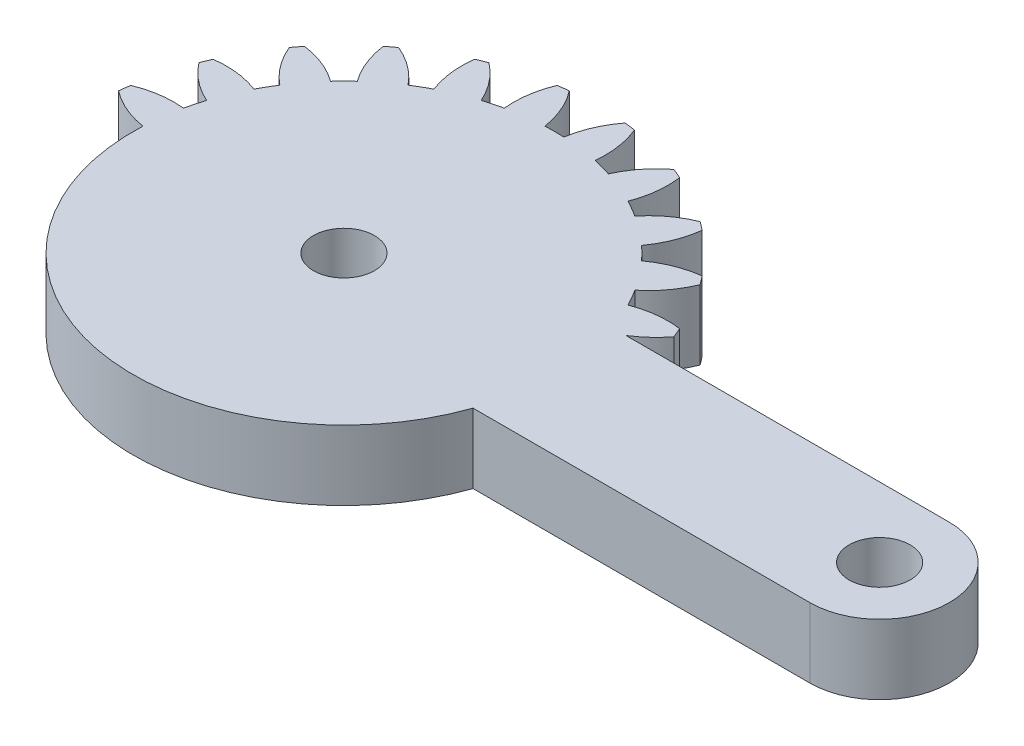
ISO-10303-21;
HEADER;
FILE_DESCRIPTION(('STEP AP214'),'2;1');
FILE_NAME('part.step','',(''),(''),'','','');
FILE_SCHEMA(('AUTOMOTIVE_DESIGN { 1 0 10303 214 1 1 1 1 }'));
ENDSEC;
DATA;
#1=APPLICATION_CONTEXT('core data for automotive mechanical design processes');
#2=APPLICATION_PROTOCOL_DEFINITION('international standard','automotive_design',2000,#1);
#3=PRODUCT_CONTEXT('',#1,'mechanical');
#4=PRODUCT('Part','Part','',(#3));
#5=PRODUCT_RELATED_PRODUCT_CATEGORY('part','',(#4));
#6=PRODUCT_DEFINITION_FORMATION('','',#4);
#7=PRODUCT_DEFINITION_CONTEXT('part definition',#1,'design');
#8=PRODUCT_DEFINITION('design','',#6,#7);
#9=PRODUCT_DEFINITION_SHAPE('','',#8);
#10=(LENGTH_UNIT() NAMED_UNIT(*) SI_UNIT(.MILLI.,.METRE.));
#11=(NAMED_UNIT(*) PLANE_ANGLE_UNIT() SI_UNIT($,.RADIAN.));
#12=(NAMED_UNIT(*) SI_UNIT($,.STERADIAN.) SOLID_ANGLE_UNIT());
#13=UNCERTAINTY_MEASURE_WITH_UNIT(LENGTH_MEASURE(1.E-05),#10,'distance_accuracy_value','');
#14=(GEOMETRIC_REPRESENTATION_CONTEXT(3) GLOBAL_UNCERTAINTY_ASSIGNED_CONTEXT((#13)) GLOBAL_UNIT_ASSIGNED_CONTEXT((#10,
#11,#12)) REPRESENTATION_CONTEXT('',''));
#15=CARTESIAN_POINT('',(0.,0.,0.));
#16=DIRECTION('',(0.,0.,1.));
#17=DIRECTION('',(1.,0.,0.));
#18=AXIS2_PLACEMENT_3D('',#15,#16,#17);
#19=CARTESIAN_POINT('',(20.6436574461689,4.,0.));
#20=DIRECTION('',(0.,1.,0.));
#21=DIRECTION('',(0.,0.,1.));
#22=AXIS2_PLACEMENT_3D('',#19,#20,#21);
#23=PLANE('',#22);
#24=CARTESIAN_POINT('',(-10.1063425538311,4.,0.));
#25=DIRECTION('',(0.,1.,0.));
#26=DIRECTION('',(0.,0.,1.));
#27=AXIS2_PLACEMENT_3D('',#24,#25,#26);
#28=CIRCLE('',#27,1.75);
#29=CARTESIAN_POINT('',(-10.1063425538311,4.,1.74999999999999));
#30=VERTEX_POINT('',#29);
#31=EDGE_CURVE('E365',#30,#30,#28,.T.);
#32=ORIENTED_EDGE('',*,*,#31,.F.);
#33=EDGE_LOOP('',(#32));
#34=FACE_BOUND('',#33,.T.);
#35=CARTESIAN_POINT('',(20.6436574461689,4.,0.));
#36=DIRECTION('',(0.,1.,0.));
#37=DIRECTION('',(0.,0.,1.));
#38=AXIS2_PLACEMENT_3D('',#35,#36,#37);
#39=CIRCLE('',#38,1.75);
#40=CARTESIAN_POINT('',(20.6436574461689,4.,1.74999999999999));
#41=VERTEX_POINT('',#40);
#42=EDGE_CURVE('E810',#41,#41,#39,.T.);
#43=ORIENTED_EDGE('',*,*,#42,.F.);
#44=EDGE_LOOP('',(#43));
#45=FACE_BOUND('',#44,.T.);
#46=CARTESIAN_POINT('',(-10.1063425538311,4.,0.));
#47=DIRECTION('',(0.,1.,0.));
#48=DIRECTION('',(0.,0.,1.));
#49=AXIS2_PLACEMENT_3D('',#46,#47,#48);
#50=CIRCLE('',#49,12.09275);
#51=CARTESIAN_POINT('',(-22.1869077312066,4.,-0.542722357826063));
#52=VERTEX_POINT('',#51);
#53=CARTESIAN_POINT('',(1.3056950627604,4.,4.));
#54=VERTEX_POINT('',#53);
#55=EDGE_CURVE('E348',#52,#54,#50,.T.);
#56=ORIENTED_EDGE('',*,*,#55,.T.);
#57=DIRECTION('',(1.,0.,0.));
#58=VECTOR('',#57,1.);
#59=CARTESIAN_POINT('',(2.08164193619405,4.,4.));
#60=LINE('',#59,#58);
#61=CARTESIAN_POINT('',(20.6436574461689,4.,4.));
#62=VERTEX_POINT('',#61);
#63=EDGE_CURVE('E34',#54,#62,#60,.T.);
#64=ORIENTED_EDGE('',*,*,#63,.T.);
#65=CARTESIAN_POINT('',(20.6436574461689,4.,0.));
#66=DIRECTION('',(0.,1.,0.));
#67=DIRECTION('',(0.,0.,1.));
#68=AXIS2_PLACEMENT_3D('',#65,#66,#67);
#69=CIRCLE('',#68,4.);
#70=CARTESIAN_POINT('',(20.6436574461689,4.,-4.));
#71=VERTEX_POINT('',#70);
#72=EDGE_CURVE('E499',#62,#71,#69,.T.);
#73=ORIENTED_EDGE('',*,*,#72,.T.);
#74=DIRECTION('',(-1.,0.,0.));
#75=VECTOR('',#74,1.);
#76=CARTESIAN_POINT('',(20.6436574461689,4.,-4.));
#77=LINE('',#76,#75);
#78=CARTESIAN_POINT('',(2.08164193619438,4.,-4.));
#79=VERTEX_POINT('',#78);
#80=EDGE_CURVE('E193',#71,#79,#77,.T.);
#81=ORIENTED_EDGE('',*,*,#80,.T.);
#82=CARTESIAN_POINT('',(-0.768289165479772,4.,-8.58670826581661));
#83=DIRECTION('',(0.,1.,0.));
#84=DIRECTION('',(0.,0.,1.));
#85=AXIS2_PLACEMENT_3D('',#82,#83,#84);
#86=CIRCLE('',#85,5.4);
#87=CARTESIAN_POINT('',(3.52174943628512,4.,-5.30713988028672));
#88=VERTEX_POINT('',#87);
#89=EDGE_CURVE('E672',#79,#88,#86,.T.);
#90=ORIENTED_EDGE('',*,*,#89,.T.);
#91=CARTESIAN_POINT('',(-10.1063425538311,4.,0.));
#92=DIRECTION('',(0.,1.,0.));
#93=DIRECTION('',(0.,0.,1.));
#94=AXIS2_PLACEMENT_3D('',#91,#92,#93);
#95=CIRCLE('',#94,14.625);
#96=CARTESIAN_POINT('',(3.28288830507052,4.,-5.88380166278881));
#97=VERTEX_POINT('',#96);
#98=EDGE_CURVE('E690',#88,#97,#95,.T.);
#99=ORIENTED_EDGE('',*,*,#98,.T.);
#100=CARTESIAN_POINT('',(2.56837796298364,4.,-0.531281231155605));
#101=DIRECTION('',(0.,1.,0.));
#102=DIRECTION('',(0.,0.,1.));
#103=AXIS2_PLACEMENT_3D('',#100,#101,#102);
#104=CIRCLE('',#103,5.4);
#105=CARTESIAN_POINT('',(0.627094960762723,4.,-5.5702712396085));
#106=VERTEX_POINT('',#105);
#107=EDGE_CURVE('E686',#97,#106,#104,.T.);
#108=ORIENTED_EDGE('',*,*,#107,.T.);
#109=CARTESIAN_POINT('',(-10.1063425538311,4.,0.));
#110=DIRECTION('',(0.,1.,0.));
#111=DIRECTION('',(0.,0.,1.));
#112=AXIS2_PLACEMENT_3D('',#109,#110,#111);
#113=CIRCLE('',#112,12.09275);
#114=CARTESIAN_POINT('',(0.0843726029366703,4.,-6.51029393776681));
#115=VERTEX_POINT('',#114);
#116=EDGE_CURVE('E689',#106,#115,#113,.T.);
#117=ORIENTED_EDGE('',*,*,#116,.T.);
#118=CARTESIAN_POINT('',(-3.308879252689,4.,-10.7109893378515));
#119=DIRECTION('',(0.,1.,0.));
#120=DIRECTION('',(0.,0.,1.));
#121=AXIS2_PLACEMENT_3D('',#118,#119,#120);
#122=CIRCLE('',#121,5.4);
#123=CARTESIAN_POINT('',(1.68379458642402,4.,-8.65351322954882));
#124=VERTEX_POINT('',#123);
#125=EDGE_CURVE('E694',#115,#124,#122,.T.);
#126=ORIENTED_EDGE('',*,*,#125,.T.);
#127=CARTESIAN_POINT('',(-10.1063425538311,4.,0.));
#128=DIRECTION('',(0.,1.,0.));
#129=DIRECTION('',(0.,0.,1.));
#130=AXIS2_PLACEMENT_3D('',#127,#128,#129);
#131=CIRCLE('',#130,14.625);
#132=CARTESIAN_POINT('',(1.30382139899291,4.,-9.1487039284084));
#133=VERTEX_POINT('',#132);
#134=EDGE_CURVE('E702',#124,#133,#131,.T.);
#135=ORIENTED_EDGE('',*,*,#134,.T.);
#136=CARTESIAN_POINT('',(1.9989916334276,4.,-3.79363732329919));
#137=DIRECTION('',(0.,1.,0.));
#138=DIRECTION('',(0.,0.,1.));
#139=AXIS2_PLACEMENT_3D('',#136,#137,#138);
#140=CIRCLE('',#139,5.4);
#141=CARTESIAN_POINT('',(-1.18033033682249,4.,-8.15848689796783));
#142=VERTEX_POINT('',#141);
#143=EDGE_CURVE('E705',#133,#142,#140,.T.);
#144=ORIENTED_EDGE('',*,*,#143,.T.);
#145=CARTESIAN_POINT('',(-10.1063425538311,4.,0.));
#146=DIRECTION('',(0.,1.,0.));
#147=DIRECTION('',(0.,0.,1.));
#148=AXIS2_PLACEMENT_3D('',#145,#146,#147);
#149=CIRCLE('',#148,12.09275);
#150=CARTESIAN_POINT('',(-1.9478556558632,4.,-8.92601221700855));
#151=VERTEX_POINT('',#150);
#152=EDGE_CURVE('E708',#142,#151,#149,.T.);
#153=ORIENTED_EDGE('',*,*,#152,.T.);
#154=CARTESIAN_POINT('',(-6.31270523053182,4.,-12.1053341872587));
#155=DIRECTION('',(0.,1.,0.));
#156=DIRECTION('',(0.,0.,1.));
#157=AXIS2_PLACEMENT_3D('',#154,#155,#156);
#158=CIRCLE('',#157,5.4);
#159=CARTESIAN_POINT('',(-0.957638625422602,4.,-11.4101639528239));
#160=VERTEX_POINT('',#159);
#161=EDGE_CURVE('E711',#151,#160,#158,.T.);
#162=ORIENTED_EDGE('',*,*,#161,.T.);
#163=CARTESIAN_POINT('',(-10.1063425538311,4.,0.));
#164=DIRECTION('',(0.,1.,0.));
#165=DIRECTION('',(0.,0.,1.));
#166=AXIS2_PLACEMENT_3D('',#163,#164,#165);
#167=CIRCLE('',#166,14.625);
#168=CARTESIAN_POINT('',(-1.45282932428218,4.,-11.7901371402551));
#169=VERTEX_POINT('',#168);
#170=EDGE_CURVE('E714',#160,#169,#167,.T.);
#171=ORIENTED_EDGE('',*,*,#170,.T.);
#172=CARTESIAN_POINT('',(0.604646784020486,4.,-6.79746330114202));
#173=DIRECTION('',(0.,1.,0.));
#174=DIRECTION('',(0.,0.,1.));
#175=AXIS2_PLACEMENT_3D('',#172,#173,#174);
#176=CIRCLE('',#175,5.4);
#177=CARTESIAN_POINT('',(-3.59604861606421,4.,-10.1907151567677));
#178=VERTEX_POINT('',#177);
#179=EDGE_CURVE('E717',#169,#178,#176,.T.);
#180=ORIENTED_EDGE('',*,*,#179,.T.);
#181=CARTESIAN_POINT('',(-10.1063425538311,4.,0.));
#182=DIRECTION('',(0.,1.,0.));
#183=DIRECTION('',(0.,0.,1.));
#184=AXIS2_PLACEMENT_3D('',#181,#182,#183);
#185=CIRCLE('',#184,12.09275);
#186=CARTESIAN_POINT('',(-4.53607131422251,4.,-10.7334375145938));
#187=VERTEX_POINT('',#186);
#188=EDGE_CURVE('E719',#178,#187,#185,.T.);
#189=ORIENTED_EDGE('',*,*,#188,.T.);
#190=CARTESIAN_POINT('',(-9.57506132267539,4.,-12.6747205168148));
#191=DIRECTION('',(0.,1.,0.));
#192=DIRECTION('',(0.,0.,1.));
#193=AXIS2_PLACEMENT_3D('',#190,#191,#192);
#194=CIRCLE('',#193,5.4);
#195=CARTESIAN_POINT('',(-4.22254089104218,4.,-13.3892308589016));
#196=VERTEX_POINT('',#195);
#197=EDGE_CURVE('E722',#187,#196,#194,.T.);
#198=ORIENTED_EDGE('',*,*,#197,.T.);
#199=CARTESIAN_POINT('',(-10.1063425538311,4.,0.));
#200=DIRECTION('',(0.,1.,0.));
#201=DIRECTION('',(0.,0.,1.));
#202=AXIS2_PLACEMENT_3D('',#199,#200,#201);
#203=CIRCLE('',#202,14.625);
#204=CARTESIAN_POINT('',(-4.79920267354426,4.,-13.6280919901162));
#205=VERTEX_POINT('',#204);
#206=EDGE_CURVE('E725',#196,#205,#203,.T.);
#207=ORIENTED_EDGE('',*,*,#206,.T.);
#208=CARTESIAN_POINT('',(-1.51963428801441,4.,-9.33805338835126));
#209=DIRECTION('',(0.,1.,0.));
#210=DIRECTION('',(0.,0.,1.));
#211=AXIS2_PLACEMENT_3D('',#208,#209,#210);
#212=CIRCLE('',#211,5.4);
#213=CARTESIAN_POINT('',(-6.45543266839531,4.,-11.528463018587));
#214=VERTEX_POINT('',#213);
#215=EDGE_CURVE('E728',#205,#214,#212,.T.);
#216=ORIENTED_EDGE('',*,*,#215,.T.);
#217=CARTESIAN_POINT('',(-10.1063425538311,4.,0.));
#218=DIRECTION('',(0.,1.,0.));
#219=DIRECTION('',(0.,0.,1.));
#220=AXIS2_PLACEMENT_3D('',#217,#218,#219);
#221=CIRCLE('',#220,12.09275);
#222=CARTESIAN_POINT('',(-7.50389175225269,4.,-11.8093967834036));
#223=VERTEX_POINT('',#222);
#224=EDGE_CURVE('E731',#214,#223,#221,.T.);
#225=ORIENTED_EDGE('',*,*,#224,.T.);
#226=CARTESIAN_POINT('',(-12.8736233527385,4.,-12.3803455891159));
#227=DIRECTION('',(0.,1.,0.));
#228=DIRECTION('',(0.,0.,1.));
#229=AXIS2_PLACEMENT_3D('',#226,#227,#228);
#230=CIRCLE('',#229,5.4);
#231=CARTESIAN_POINT('',(-7.88841451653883,4.,-14.4558438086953));
#232=VERTEX_POINT('',#231);
#233=EDGE_CURVE('E734',#223,#232,#230,.T.);
#234=ORIENTED_EDGE('',*,*,#233,.T.);
#235=CARTESIAN_POINT('',(-10.1063425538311,4.,0.));
#236=DIRECTION('',(0.,1.,0.));
#237=DIRECTION('',(0.,0.,1.));
#238=AXIS2_PLACEMENT_3D('',#235,#236,#237);
#239=CIRCLE('',#238,14.625);
#240=CARTESIAN_POINT('',(-8.50724883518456,4.,-14.5373148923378));
#241=VERTEX_POINT('',#240);
#242=EDGE_CURVE('E737',#232,#241,#239,.T.);
#243=ORIENTED_EDGE('',*,*,#242,.T.);
#244=CARTESIAN_POINT('',(-4.22908533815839,4.,-11.2422705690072));
#245=DIRECTION('',(0.,1.,0.));
#246=DIRECTION('',(0.,0.,1.));
#247=AXIS2_PLACEMENT_3D('',#244,#245,#246);
#248=CIRCLE('',#247,5.4);
#249=CARTESIAN_POINT('',(-9.56362019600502,4.,-12.0805651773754));
#250=VERTEX_POINT('',#249);
#251=EDGE_CURVE('E740',#241,#250,#248,.T.);
#252=ORIENTED_EDGE('',*,*,#251,.T.);
#253=CARTESIAN_POINT('',(-10.1063425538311,4.,0.));
#254=DIRECTION('',(0.,1.,0.));
#255=DIRECTION('',(0.,0.,1.));
#256=AXIS2_PLACEMENT_3D('',#253,#254,#255);
#257=CIRCLE('',#256,12.09275);
#258=CARTESIAN_POINT('',(-10.6490649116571,4.,-12.0805651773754));
#259=VERTEX_POINT('',#258);
#260=EDGE_CURVE('E743',#250,#259,#257,.T.);
#261=ORIENTED_EDGE('',*,*,#260,.T.);
#262=CARTESIAN_POINT('',(-15.9835997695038,4.,-11.2422705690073));
#263=DIRECTION('',(0.,1.,0.));
#264=DIRECTION('',(0.,0.,1.));
#265=AXIS2_PLACEMENT_3D('',#262,#263,#264);
#266=CIRCLE('',#265,5.4);
#267=CARTESIAN_POINT('',(-11.7054362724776,4.,-14.5373148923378));
#268=VERTEX_POINT('',#267);
#269=EDGE_CURVE('E746',#259,#268,#266,.T.);
#270=ORIENTED_EDGE('',*,*,#269,.T.);
#271=CARTESIAN_POINT('',(-10.1063425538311,4.,0.));
#272=DIRECTION('',(0.,1.,0.));
#273=DIRECTION('',(0.,0.,1.));
#274=AXIS2_PLACEMENT_3D('',#271,#272,#273);
#275=CIRCLE('',#274,14.625);
#276=CARTESIAN_POINT('',(-12.3242705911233,4.,-14.4558438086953));
#277=VERTEX_POINT('',#276);
#278=EDGE_CURVE('E749',#268,#277,#275,.T.);
#279=ORIENTED_EDGE('',*,*,#278,.T.);
#280=CARTESIAN_POINT('',(-7.33906175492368,4.,-12.3803455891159));
#281=DIRECTION('',(0.,1.,0.));
#282=DIRECTION('',(0.,0.,1.));
#283=AXIS2_PLACEMENT_3D('',#280,#281,#282);
#284=CIRCLE('',#283,5.4);
#285=CARTESIAN_POINT('',(-12.7087933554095,4.,-11.8093967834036));
#286=VERTEX_POINT('',#285);
#287=EDGE_CURVE('E752',#277,#286,#284,.T.);
#288=ORIENTED_EDGE('',*,*,#287,.T.);
#289=CARTESIAN_POINT('',(-10.1063425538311,4.,0.));
#290=DIRECTION('',(0.,1.,0.));
#291=DIRECTION('',(0.,0.,1.));
#292=AXIS2_PLACEMENT_3D('',#289,#290,#291);
#293=CIRCLE('',#292,12.09275);
#294=CARTESIAN_POINT('',(-13.7572524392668,4.,-11.528463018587));
#295=VERTEX_POINT('',#294);
#296=EDGE_CURVE('E755',#286,#295,#293,.T.);
#297=ORIENTED_EDGE('',*,*,#296,.T.);
#298=CARTESIAN_POINT('',(-18.6930508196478,4.,-9.33805338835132));
#299=DIRECTION('',(0.,1.,0.));
#300=DIRECTION('',(0.,0.,1.));
#301=AXIS2_PLACEMENT_3D('',#298,#299,#300);
#302=CIRCLE('',#301,5.4);
#303=CARTESIAN_POINT('',(-15.4134824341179,4.,-13.6280919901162));
#304=VERTEX_POINT('',#303);
#305=EDGE_CURVE('E758',#295,#304,#302,.T.);
#306=ORIENTED_EDGE('',*,*,#305,.T.);
#307=CARTESIAN_POINT('',(-10.1063425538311,4.,0.));
#308=DIRECTION('',(0.,1.,0.));
#309=DIRECTION('',(0.,0.,1.));
#310=AXIS2_PLACEMENT_3D('',#307,#308,#309);
#311=CIRCLE('',#310,14.625);
#312=CARTESIAN_POINT('',(-15.99014421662,4.,-13.3892308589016));
#313=VERTEX_POINT('',#312);
#314=EDGE_CURVE('E761',#304,#313,#311,.T.);
#315=ORIENTED_EDGE('',*,*,#314,.T.);
#316=CARTESIAN_POINT('',(-10.6376237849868,4.,-12.6747205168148));
#317=DIRECTION('',(0.,1.,0.));
#318=DIRECTION('',(0.,0.,1.));
#319=AXIS2_PLACEMENT_3D('',#316,#317,#318);
#320=CIRCLE('',#319,5.4);
#321=CARTESIAN_POINT('',(-15.6766137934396,4.,-10.7334375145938));
#322=VERTEX_POINT('',#321);
#323=EDGE_CURVE('E764',#313,#322,#320,.T.);
#324=ORIENTED_EDGE('',*,*,#323,.T.);
#325=CARTESIAN_POINT('',(-10.1063425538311,4.,0.));
#326=DIRECTION('',(0.,1.,0.));
#327=DIRECTION('',(0.,0.,1.));
#328=AXIS2_PLACEMENT_3D('',#325,#326,#327);
#329=CIRCLE('',#328,12.09275);
#330=CARTESIAN_POINT('',(-16.616636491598,4.,-10.1907151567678));
#331=VERTEX_POINT('',#330);
#332=EDGE_CURVE('E767',#322,#331,#329,.T.);
#333=ORIENTED_EDGE('',*,*,#332,.T.);
#334=CARTESIAN_POINT('',(-20.8173318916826,4.,-6.79746330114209));
#335=DIRECTION('',(0.,1.,0.));
#336=DIRECTION('',(0.,0.,1.));
#337=AXIS2_PLACEMENT_3D('',#334,#335,#336);
#338=CIRCLE('',#337,5.4);
#339=CARTESIAN_POINT('',(-18.75985578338,4.,-11.7901371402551));
#340=VERTEX_POINT('',#339);
#341=EDGE_CURVE('E770',#331,#340,#338,.T.);
#342=ORIENTED_EDGE('',*,*,#341,.T.);
#343=CARTESIAN_POINT('',(-10.1063425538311,4.,0.));
#344=DIRECTION('',(0.,1.,0.));
#345=DIRECTION('',(0.,0.,1.));
#346=AXIS2_PLACEMENT_3D('',#343,#344,#345);
#347=CIRCLE('',#346,14.625);
#348=CARTESIAN_POINT('',(-19.2550464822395,4.,-11.410163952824));
#349=VERTEX_POINT('',#348);
#350=EDGE_CURVE('E773',#340,#349,#347,.T.);
#351=ORIENTED_EDGE('',*,*,#350,.T.);
#352=CARTESIAN_POINT('',(-13.8999798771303,4.,-12.1053341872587));
#353=DIRECTION('',(0.,1.,0.));
#354=DIRECTION('',(0.,0.,1.));
#355=AXIS2_PLACEMENT_3D('',#352,#353,#354);
#356=CIRCLE('',#355,5.4);
#357=CARTESIAN_POINT('',(-18.264829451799,4.,-8.92601221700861));
#358=VERTEX_POINT('',#357);
#359=EDGE_CURVE('E776',#349,#358,#356,.T.);
#360=ORIENTED_EDGE('',*,*,#359,.T.);
#361=CARTESIAN_POINT('',(-10.1063425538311,4.,0.));
#362=DIRECTION('',(0.,1.,0.));
#363=DIRECTION('',(0.,0.,1.));
#364=AXIS2_PLACEMENT_3D('',#361,#362,#363);
#365=CIRCLE('',#364,12.09275);
#366=CARTESIAN_POINT('',(-19.0323547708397,4.,-8.15848689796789));
#367=VERTEX_POINT('',#366);
#368=EDGE_CURVE('E779',#358,#367,#365,.T.);
#369=ORIENTED_EDGE('',*,*,#368,.T.);
#370=CARTESIAN_POINT('',(-22.2116767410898,4.,-3.79363732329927));
#371=DIRECTION('',(0.,1.,0.));
#372=DIRECTION('',(0.,0.,1.));
#373=AXIS2_PLACEMENT_3D('',#370,#371,#372);
#374=CIRCLE('',#373,5.4);
#375=CARTESIAN_POINT('',(-21.5165065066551,4.,-9.14870392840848));
#376=VERTEX_POINT('',#375);
#377=EDGE_CURVE('E782',#367,#376,#374,.T.);
#378=ORIENTED_EDGE('',*,*,#377,.T.);
#379=CARTESIAN_POINT('',(-10.1063425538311,4.,0.));
#380=DIRECTION('',(0.,1.,0.));
#381=DIRECTION('',(0.,0.,1.));
#382=AXIS2_PLACEMENT_3D('',#379,#380,#381);
#383=CIRCLE('',#382,14.625);
#384=CARTESIAN_POINT('',(-21.8964796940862,4.,-8.65351322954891));
#385=VERTEX_POINT('',#384);
#386=EDGE_CURVE('E784',#376,#385,#383,.T.);
#387=ORIENTED_EDGE('',*,*,#386,.T.);
#388=CARTESIAN_POINT('',(-16.9038058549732,4.,-10.7109893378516));
#389=DIRECTION('',(0.,1.,0.));
#390=DIRECTION('',(0.,0.,1.));
#391=AXIS2_PLACEMENT_3D('',#388,#389,#390);
#392=CIRCLE('',#391,5.4);
#393=CARTESIAN_POINT('',(-20.2970577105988,4.,-6.51029393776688));
#394=VERTEX_POINT('',#393);
#395=EDGE_CURVE('E787',#385,#394,#392,.T.);
#396=ORIENTED_EDGE('',*,*,#395,.T.);
#397=CARTESIAN_POINT('',(-10.1063425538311,4.,0.));
#398=DIRECTION('',(0.,1.,0.));
#399=DIRECTION('',(0.,0.,1.));
#400=AXIS2_PLACEMENT_3D('',#397,#398,#399);
#401=CIRCLE('',#400,12.09275);
#402=CARTESIAN_POINT('',(-20.8397800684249,4.,-5.57027123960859));
#403=VERTEX_POINT('',#402);
#404=EDGE_CURVE('E790',#394,#403,#401,.T.);
#405=ORIENTED_EDGE('',*,*,#404,.T.);
#406=CARTESIAN_POINT('',(-22.7810630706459,4.,-0.531281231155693));
#407=DIRECTION('',(0.,1.,0.));
#408=DIRECTION('',(0.,0.,1.));
#409=AXIS2_PLACEMENT_3D('',#406,#407,#408);
#410=CIRCLE('',#409,5.4);
#411=CARTESIAN_POINT('',(-23.4955734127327,4.,-5.8838016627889));
#412=VERTEX_POINT('',#411);
#413=EDGE_CURVE('E793',#403,#412,#410,.T.);
#414=ORIENTED_EDGE('',*,*,#413,.T.);
#415=CARTESIAN_POINT('',(-10.1063425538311,4.,0.));
#416=DIRECTION('',(0.,1.,0.));
#417=DIRECTION('',(0.,0.,1.));
#418=AXIS2_PLACEMENT_3D('',#415,#416,#417);
#419=CIRCLE('',#418,14.625);
#420=CARTESIAN_POINT('',(-23.7344345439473,4.,-5.30713988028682));
#421=VERTEX_POINT('',#420);
#422=EDGE_CURVE('E796',#412,#421,#419,.T.);
#423=ORIENTED_EDGE('',*,*,#422,.T.);
#424=CARTESIAN_POINT('',(-19.4443959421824,4.,-8.58670826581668));
#425=DIRECTION('',(0.,1.,0.));
#426=DIRECTION('',(0.,0.,1.));
#427=AXIS2_PLACEMENT_3D('',#424,#425,#426);
#428=CIRCLE('',#427,5.4);
#429=CARTESIAN_POINT('',(-21.6348055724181,4.,-3.65090988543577));
#430=VERTEX_POINT('',#429);
#431=EDGE_CURVE('E799',#421,#430,#428,.T.);
#432=ORIENTED_EDGE('',*,*,#431,.T.);
#433=CARTESIAN_POINT('',(-10.1063425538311,4.,0.));
#434=DIRECTION('',(0.,1.,0.));
#435=DIRECTION('',(0.,0.,1.));
#436=AXIS2_PLACEMENT_3D('',#433,#434,#435);
#437=CIRCLE('',#436,12.09275);
#438=CARTESIAN_POINT('',(-21.9157393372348,4.,-2.6024508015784));
#439=VERTEX_POINT('',#438);
#440=EDGE_CURVE('E802',#430,#439,#437,.T.);
#441=ORIENTED_EDGE('',*,*,#440,.T.);
#442=CARTESIAN_POINT('',(-22.486688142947,4.,2.76728079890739));
#443=DIRECTION('',(0.,1.,0.));
#444=DIRECTION('',(0.,0.,1.));
#445=AXIS2_PLACEMENT_3D('',#442,#443,#444);
#446=CIRCLE('',#445,5.4);
#447=CARTESIAN_POINT('',(-24.5621863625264,4.,-2.21792803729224));
#448=VERTEX_POINT('',#447);
#449=EDGE_CURVE('E328',#439,#448,#446,.T.);
#450=ORIENTED_EDGE('',*,*,#449,.T.);
#451=CARTESIAN_POINT('',(-10.1063425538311,4.,0.));
#452=DIRECTION('',(0.,1.,0.));
#453=DIRECTION('',(0.,0.,1.));
#454=AXIS2_PLACEMENT_3D('',#451,#452,#453);
#455=CIRCLE('',#454,14.625);
#456=CARTESIAN_POINT('',(-24.6436574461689,4.,-1.59909371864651));
#457=VERTEX_POINT('',#456);
#458=EDGE_CURVE('E322',#448,#457,#455,.T.);
#459=ORIENTED_EDGE('',*,*,#458,.T.);
#460=CARTESIAN_POINT('',(-21.3486131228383,4.,-5.8772572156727));
#461=DIRECTION('',(0.,1.,0.));
#462=DIRECTION('',(0.,0.,1.));
#463=AXIS2_PLACEMENT_3D('',#460,#461,#462);
#464=CIRCLE('',#463,5.4);
#465=EDGE_CURVE('E325',#457,#52,#464,.T.);
#466=ORIENTED_EDGE('',*,*,#465,.T.);
#467=EDGE_LOOP('',(#56,#64,#73,#81,#90,#99,#108,#117,#126,#135,#144,#153,#162,#171,#180,#189,
#198,#207,#216,#225,#234,#243,#252,#261,#270,#279,#288,#297,#306,#315,#324,#333,#342,#351,#360,
#369,#378,#387,#396,#405,#414,#423,#432,#441,#450,#459,#466));
#468=FACE_BOUND('',#467,.T.);
#469=ADVANCED_FACE('F16',(#34,#45,#468),#23,.T.);
#470=CARTESIAN_POINT('',(20.6436574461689,0.,0.));
#471=DIRECTION('',(0.,1.,0.));
#472=DIRECTION('',(0.,0.,1.));
#473=AXIS2_PLACEMENT_3D('',#470,#471,#472);
#474=PLANE('',#473);
#475=CARTESIAN_POINT('',(20.6436574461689,0.,0.));
#476=DIRECTION('',(0.,1.,0.));
#477=DIRECTION('',(0.,0.,1.));
#478=AXIS2_PLACEMENT_3D('',#475,#476,#477);
#479=CIRCLE('',#478,1.75);
#480=CARTESIAN_POINT('',(20.6436574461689,0.,1.74999999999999));
#481=VERTEX_POINT('',#480);
#482=EDGE_CURVE('E808',#481,#481,#479,.T.);
#483=ORIENTED_EDGE('',*,*,#482,.T.);
#484=EDGE_LOOP('',(#483));
#485=FACE_BOUND('',#484,.T.);
#486=CARTESIAN_POINT('',(-10.1063425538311,0.,0.));
#487=DIRECTION('',(0.,1.,0.));
#488=DIRECTION('',(0.,0.,1.));
#489=AXIS2_PLACEMENT_3D('',#486,#487,#488);
#490=CIRCLE('',#489,1.75);
#491=CARTESIAN_POINT('',(-10.1063425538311,0.,1.74999999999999));
#492=VERTEX_POINT('',#491);
#493=EDGE_CURVE('E817',#492,#492,#490,.T.);
#494=ORIENTED_EDGE('',*,*,#493,.T.);
#495=EDGE_LOOP('',(#494));
#496=FACE_BOUND('',#495,.T.);
#497=DIRECTION('',(1.,0.,0.));
#498=VECTOR('',#497,1.);
#499=CARTESIAN_POINT('',(2.08164193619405,0.,4.));
#500=LINE('',#499,#498);
#501=CARTESIAN_POINT('',(1.3056950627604,0.,4.));
#502=VERTEX_POINT('',#501);
#503=CARTESIAN_POINT('',(20.6436574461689,0.,4.));
#504=VERTEX_POINT('',#503);
#505=EDGE_CURVE('E185',#502,#504,#500,.T.);
#506=ORIENTED_EDGE('',*,*,#505,.F.);
#507=CARTESIAN_POINT('',(-10.1063425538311,0.,0.));
#508=DIRECTION('',(0.,1.,0.));
#509=DIRECTION('',(0.,0.,1.));
#510=AXIS2_PLACEMENT_3D('',#507,#508,#509);
#511=CIRCLE('',#510,12.09275);
#512=CARTESIAN_POINT('',(-22.1869077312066,0.,-0.542722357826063));
#513=VERTEX_POINT('',#512);
#514=EDGE_CURVE('E179',#513,#502,#511,.T.);
#515=ORIENTED_EDGE('',*,*,#514,.F.);
#516=CARTESIAN_POINT('',(-21.3486131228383,0.,-5.8772572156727));
#517=DIRECTION('',(0.,1.,0.));
#518=DIRECTION('',(0.,0.,1.));
#519=AXIS2_PLACEMENT_3D('',#516,#517,#518);
#520=CIRCLE('',#519,5.4);
#521=CARTESIAN_POINT('',(-24.6436574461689,0.,-1.59909371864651));
#522=VERTEX_POINT('',#521);
#523=EDGE_CURVE('E492',#522,#513,#520,.T.);
#524=ORIENTED_EDGE('',*,*,#523,.F.);
#525=CARTESIAN_POINT('',(-10.1063425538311,0.,0.));
#526=DIRECTION('',(0.,1.,0.));
#527=DIRECTION('',(0.,0.,1.));
#528=AXIS2_PLACEMENT_3D('',#525,#526,#527);
#529=CIRCLE('',#528,14.625);
#530=CARTESIAN_POINT('',(-24.5621863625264,0.,-2.21792803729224));
#531=VERTEX_POINT('',#530);
#532=EDGE_CURVE('E338',#531,#522,#529,.T.);
#533=ORIENTED_EDGE('',*,*,#532,.F.);
#534=CARTESIAN_POINT('',(-22.486688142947,0.,2.76728079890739));
#535=DIRECTION('',(0.,1.,0.));
#536=DIRECTION('',(0.,0.,1.));
#537=AXIS2_PLACEMENT_3D('',#534,#535,#536);
#538=CIRCLE('',#537,5.4);
#539=CARTESIAN_POINT('',(-21.9157393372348,0.,-2.6024508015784));
#540=VERTEX_POINT('',#539);
#541=EDGE_CURVE('E487',#540,#531,#538,.T.);
#542=ORIENTED_EDGE('',*,*,#541,.F.);
#543=CARTESIAN_POINT('',(-10.1063425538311,0.,0.));
#544=DIRECTION('',(0.,1.,0.));
#545=DIRECTION('',(0.,0.,1.));
#546=AXIS2_PLACEMENT_3D('',#543,#544,#545);
#547=CIRCLE('',#546,12.09275);
#548=CARTESIAN_POINT('',(-21.6348055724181,0.,-3.65090988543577));
#549=VERTEX_POINT('',#548);
#550=EDGE_CURVE('E484',#549,#540,#547,.T.);
#551=ORIENTED_EDGE('',*,*,#550,.F.);
#552=CARTESIAN_POINT('',(-19.4443959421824,0.,-8.58670826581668));
#553=DIRECTION('',(0.,1.,0.));
#554=DIRECTION('',(0.,0.,1.));
#555=AXIS2_PLACEMENT_3D('',#552,#553,#554);
#556=CIRCLE('',#555,5.4);
#557=CARTESIAN_POINT('',(-23.7344345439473,0.,-5.30713988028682));
#558=VERTEX_POINT('',#557);
#559=EDGE_CURVE('E481',#558,#549,#556,.T.);
#560=ORIENTED_EDGE('',*,*,#559,.F.);
#561=CARTESIAN_POINT('',(-10.1063425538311,0.,0.));
#562=DIRECTION('',(0.,1.,0.));
#563=DIRECTION('',(0.,0.,1.));
#564=AXIS2_PLACEMENT_3D('',#561,#562,#563);
#565=CIRCLE('',#564,14.625);
#566=CARTESIAN_POINT('',(-23.4955734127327,0.,-5.8838016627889));
#567=VERTEX_POINT('',#566);
#568=EDGE_CURVE('E478',#567,#558,#565,.T.);
#569=ORIENTED_EDGE('',*,*,#568,.F.);
#570=CARTESIAN_POINT('',(-22.7810630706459,0.,-0.531281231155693));
#571=DIRECTION('',(0.,1.,0.));
#572=DIRECTION('',(0.,0.,1.));
#573=AXIS2_PLACEMENT_3D('',#570,#571,#572);
#574=CIRCLE('',#573,5.4);
#575=CARTESIAN_POINT('',(-20.8397800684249,0.,-5.57027123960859));
#576=VERTEX_POINT('',#575);
#577=EDGE_CURVE('E475',#576,#567,#574,.T.);
#578=ORIENTED_EDGE('',*,*,#577,.F.);
#579=CARTESIAN_POINT('',(-10.1063425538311,0.,0.));
#580=DIRECTION('',(0.,1.,0.));
#581=DIRECTION('',(0.,0.,1.));
#582=AXIS2_PLACEMENT_3D('',#579,#580,#581);
#583=CIRCLE('',#582,12.09275);
#584=CARTESIAN_POINT('',(-20.2970577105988,0.,-6.51029393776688));
#585=VERTEX_POINT('',#584);
#586=EDGE_CURVE('E472',#585,#576,#583,.T.);
#587=ORIENTED_EDGE('',*,*,#586,.F.);
#588=CARTESIAN_POINT('',(-16.9038058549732,0.,-10.7109893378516));
#589=DIRECTION('',(0.,1.,0.));
#590=DIRECTION('',(0.,0.,1.));
#591=AXIS2_PLACEMENT_3D('',#588,#589,#590);
#592=CIRCLE('',#591,5.4);
#593=CARTESIAN_POINT('',(-21.8964796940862,0.,-8.65351322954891));
#594=VERTEX_POINT('',#593);
#595=EDGE_CURVE('E469',#594,#585,#592,.T.);
#596=ORIENTED_EDGE('',*,*,#595,.F.);
#597=CARTESIAN_POINT('',(-10.1063425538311,0.,0.));
#598=DIRECTION('',(0.,1.,0.));
#599=DIRECTION('',(0.,0.,1.));
#600=AXIS2_PLACEMENT_3D('',#597,#598,#599);
#601=CIRCLE('',#600,14.625);
#602=CARTESIAN_POINT('',(-21.5165065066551,0.,-9.14870392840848));
#603=VERTEX_POINT('',#602);
#604=EDGE_CURVE('E466',#603,#594,#601,.T.);
#605=ORIENTED_EDGE('',*,*,#604,.F.);
#606=CARTESIAN_POINT('',(-22.2116767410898,0.,-3.79363732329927));
#607=DIRECTION('',(0.,1.,0.));
#608=DIRECTION('',(0.,0.,1.));
#609=AXIS2_PLACEMENT_3D('',#606,#607,#608);
#610=CIRCLE('',#609,5.4);
#611=CARTESIAN_POINT('',(-19.0323547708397,0.,-8.15848689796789));
#612=VERTEX_POINT('',#611);
#613=EDGE_CURVE('E463',#612,#603,#610,.T.);
#614=ORIENTED_EDGE('',*,*,#613,.F.);
#615=CARTESIAN_POINT('',(-10.1063425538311,0.,0.));
#616=DIRECTION('',(0.,1.,0.));
#617=DIRECTION('',(0.,0.,1.));
#618=AXIS2_PLACEMENT_3D('',#615,#616,#617);
#619=CIRCLE('',#618,12.09275);
#620=CARTESIAN_POINT('',(-18.264829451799,0.,-8.92601221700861));
#621=VERTEX_POINT('',#620);
#622=EDGE_CURVE('E460',#621,#612,#619,.T.);
#623=ORIENTED_EDGE('',*,*,#622,.F.);
#624=CARTESIAN_POINT('',(-13.8999798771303,0.,-12.1053341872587));
#625=DIRECTION('',(0.,1.,0.));
#626=DIRECTION('',(0.,0.,1.));
#627=AXIS2_PLACEMENT_3D('',#624,#625,#626);
#628=CIRCLE('',#627,5.4);
#629=CARTESIAN_POINT('',(-19.2550464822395,0.,-11.410163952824));
#630=VERTEX_POINT('',#629);
#631=EDGE_CURVE('E457',#630,#621,#628,.T.);
#632=ORIENTED_EDGE('',*,*,#631,.F.);
#633=CARTESIAN_POINT('',(-10.1063425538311,0.,0.));
#634=DIRECTION('',(0.,1.,0.));
#635=DIRECTION('',(0.,0.,1.));
#636=AXIS2_PLACEMENT_3D('',#633,#634,#635);
#637=CIRCLE('',#636,14.625);
#638=CARTESIAN_POINT('',(-18.75985578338,0.,-11.7901371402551));
#639=VERTEX_POINT('',#638);
#640=EDGE_CURVE('E454',#639,#630,#637,.T.);
#641=ORIENTED_EDGE('',*,*,#640,.F.);
#642=CARTESIAN_POINT('',(-20.8173318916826,0.,-6.79746330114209));
#643=DIRECTION('',(0.,1.,0.));
#644=DIRECTION('',(0.,0.,1.));
#645=AXIS2_PLACEMENT_3D('',#642,#643,#644);
#646=CIRCLE('',#645,5.4);
#647=CARTESIAN_POINT('',(-16.616636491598,0.,-10.1907151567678));
#648=VERTEX_POINT('',#647);
#649=EDGE_CURVE('E451',#648,#639,#646,.T.);
#650=ORIENTED_EDGE('',*,*,#649,.F.);
#651=CARTESIAN_POINT('',(-10.1063425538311,0.,0.));
#652=DIRECTION('',(0.,1.,0.));
#653=DIRECTION('',(0.,0.,1.));
#654=AXIS2_PLACEMENT_3D('',#651,#652,#653);
#655=CIRCLE('',#654,12.09275);
#656=CARTESIAN_POINT('',(-15.6766137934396,0.,-10.7334375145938));
#657=VERTEX_POINT('',#656);
#658=EDGE_CURVE('E448',#657,#648,#655,.T.);
#659=ORIENTED_EDGE('',*,*,#658,.F.);
#660=CARTESIAN_POINT('',(-10.6376237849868,0.,-12.6747205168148));
#661=DIRECTION('',(0.,1.,0.));
#662=DIRECTION('',(0.,0.,1.));
#663=AXIS2_PLACEMENT_3D('',#660,#661,#662);
#664=CIRCLE('',#663,5.4);
#665=CARTESIAN_POINT('',(-15.99014421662,0.,-13.3892308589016));
#666=VERTEX_POINT('',#665);
#667=EDGE_CURVE('E446',#666,#657,#664,.T.);
#668=ORIENTED_EDGE('',*,*,#667,.F.);
#669=CARTESIAN_POINT('',(-10.1063425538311,0.,0.));
#670=DIRECTION('',(0.,1.,0.));
#671=DIRECTION('',(0.,0.,1.));
#672=AXIS2_PLACEMENT_3D('',#669,#670,#671);
#673=CIRCLE('',#672,14.625);
#674=CARTESIAN_POINT('',(-15.4134824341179,0.,-13.6280919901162));
#675=VERTEX_POINT('',#674);
#676=EDGE_CURVE('E443',#675,#666,#673,.T.);
#677=ORIENTED_EDGE('',*,*,#676,.F.);
#678=CARTESIAN_POINT('',(-18.6930508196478,0.,-9.33805338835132));
#679=DIRECTION('',(0.,1.,0.));
#680=DIRECTION('',(0.,0.,1.));
#681=AXIS2_PLACEMENT_3D('',#678,#679,#680);
#682=CIRCLE('',#681,5.4);
#683=CARTESIAN_POINT('',(-13.7572524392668,0.,-11.528463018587));
#684=VERTEX_POINT('',#683);
#685=EDGE_CURVE('E440',#684,#675,#682,.T.);
#686=ORIENTED_EDGE('',*,*,#685,.F.);
#687=CARTESIAN_POINT('',(-10.1063425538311,0.,0.));
#688=DIRECTION('',(0.,1.,0.));
#689=DIRECTION('',(0.,0.,1.));
#690=AXIS2_PLACEMENT_3D('',#687,#688,#689);
#691=CIRCLE('',#690,12.09275);
#692=CARTESIAN_POINT('',(-12.7087933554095,0.,-11.8093967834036));
#693=VERTEX_POINT('',#692);
#694=EDGE_CURVE('E437',#693,#684,#691,.T.);
#695=ORIENTED_EDGE('',*,*,#694,.F.);
#696=CARTESIAN_POINT('',(-7.33906175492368,0.,-12.3803455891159));
#697=DIRECTION('',(0.,1.,0.));
#698=DIRECTION('',(0.,0.,1.));
#699=AXIS2_PLACEMENT_3D('',#696,#697,#698);
#700=CIRCLE('',#699,5.4);
#701=CARTESIAN_POINT('',(-12.3242705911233,0.,-14.4558438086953));
#702=VERTEX_POINT('',#701);
#703=EDGE_CURVE('E434',#702,#693,#700,.T.);
#704=ORIENTED_EDGE('',*,*,#703,.F.);
#705=CARTESIAN_POINT('',(-10.1063425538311,0.,0.));
#706=DIRECTION('',(0.,1.,0.));
#707=DIRECTION('',(0.,0.,1.));
#708=AXIS2_PLACEMENT_3D('',#705,#706,#707);
#709=CIRCLE('',#708,14.625);
#710=CARTESIAN_POINT('',(-11.7054362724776,0.,-14.5373148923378));
#711=VERTEX_POINT('',#710);
#712=EDGE_CURVE('E431',#711,#702,#709,.T.);
#713=ORIENTED_EDGE('',*,*,#712,.F.);
#714=CARTESIAN_POINT('',(-15.9835997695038,0.,-11.2422705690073));
#715=DIRECTION('',(0.,1.,0.));
#716=DIRECTION('',(0.,0.,1.));
#717=AXIS2_PLACEMENT_3D('',#714,#715,#716);
#718=CIRCLE('',#717,5.4);
#719=CARTESIAN_POINT('',(-10.6490649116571,0.,-12.0805651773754));
#720=VERTEX_POINT('',#719);
#721=EDGE_CURVE('E428',#720,#711,#718,.T.);
#722=ORIENTED_EDGE('',*,*,#721,.F.);
#723=CARTESIAN_POINT('',(-10.1063425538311,0.,0.));
#724=DIRECTION('',(0.,1.,0.));
#725=DIRECTION('',(0.,0.,1.));
#726=AXIS2_PLACEMENT_3D('',#723,#724,#725);
#727=CIRCLE('',#726,12.09275);
#728=CARTESIAN_POINT('',(-9.56362019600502,0.,-12.0805651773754));
#729=VERTEX_POINT('',#728);
#730=EDGE_CURVE('E425',#729,#720,#727,.T.);
#731=ORIENTED_EDGE('',*,*,#730,.F.);
#732=CARTESIAN_POINT('',(-4.22908533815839,0.,-11.2422705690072));
#733=DIRECTION('',(0.,1.,0.));
#734=DIRECTION('',(0.,0.,1.));
#735=AXIS2_PLACEMENT_3D('',#732,#733,#734);
#736=CIRCLE('',#735,5.4);
#737=CARTESIAN_POINT('',(-8.50724883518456,0.,-14.5373148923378));
#738=VERTEX_POINT('',#737);
#739=EDGE_CURVE('E422',#738,#729,#736,.T.);
#740=ORIENTED_EDGE('',*,*,#739,.F.);
#741=CARTESIAN_POINT('',(-10.1063425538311,0.,0.));
#742=DIRECTION('',(0.,1.,0.));
#743=DIRECTION('',(0.,0.,1.));
#744=AXIS2_PLACEMENT_3D('',#741,#742,#743);
#745=CIRCLE('',#744,14.625);
#746=CARTESIAN_POINT('',(-7.88841451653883,0.,-14.4558438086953));
#747=VERTEX_POINT('',#746);
#748=EDGE_CURVE('E419',#747,#738,#745,.T.);
#749=ORIENTED_EDGE('',*,*,#748,.F.);
#750=CARTESIAN_POINT('',(-12.8736233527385,0.,-12.3803455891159));
#751=DIRECTION('',(0.,1.,0.));
#752=DIRECTION('',(0.,0.,1.));
#753=AXIS2_PLACEMENT_3D('',#750,#751,#752);
#754=CIRCLE('',#753,5.4);
#755=CARTESIAN_POINT('',(-7.50389175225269,0.,-11.8093967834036));
#756=VERTEX_POINT('',#755);
#757=EDGE_CURVE('E416',#756,#747,#754,.T.);
#758=ORIENTED_EDGE('',*,*,#757,.F.);
#759=CARTESIAN_POINT('',(-10.1063425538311,0.,0.));
#760=DIRECTION('',(0.,1.,0.));
#761=DIRECTION('',(0.,0.,1.));
#762=AXIS2_PLACEMENT_3D('',#759,#760,#761);
#763=CIRCLE('',#762,12.09275);
#764=CARTESIAN_POINT('',(-6.45543266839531,0.,-11.528463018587));
#765=VERTEX_POINT('',#764);
#766=EDGE_CURVE('E413',#765,#756,#763,.T.);
#767=ORIENTED_EDGE('',*,*,#766,.F.);
#768=CARTESIAN_POINT('',(-1.51963428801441,0.,-9.33805338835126));
#769=DIRECTION('',(0.,1.,0.));
#770=DIRECTION('',(0.,0.,1.));
#771=AXIS2_PLACEMENT_3D('',#768,#769,#770);
#772=CIRCLE('',#771,5.4);
#773=CARTESIAN_POINT('',(-4.79920267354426,0.,-13.6280919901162));
#774=VERTEX_POINT('',#773);
#775=EDGE_CURVE('E410',#774,#765,#772,.T.);
#776=ORIENTED_EDGE('',*,*,#775,.F.);
#777=CARTESIAN_POINT('',(-10.1063425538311,0.,0.));
#778=DIRECTION('',(0.,1.,0.));
#779=DIRECTION('',(0.,0.,1.));
#780=AXIS2_PLACEMENT_3D('',#777,#778,#779);
#781=CIRCLE('',#780,14.625);
#782=CARTESIAN_POINT('',(-4.22254089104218,0.,-13.3892308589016));
#783=VERTEX_POINT('',#782);
#784=EDGE_CURVE('E407',#783,#774,#781,.T.);
#785=ORIENTED_EDGE('',*,*,#784,.F.);
#786=CARTESIAN_POINT('',(-9.57506132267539,0.,-12.6747205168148));
#787=DIRECTION('',(0.,1.,0.));
#788=DIRECTION('',(0.,0.,1.));
#789=AXIS2_PLACEMENT_3D('',#786,#787,#788);
#790=CIRCLE('',#789,5.4);
#791=CARTESIAN_POINT('',(-4.53607131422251,0.,-10.7334375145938));
#792=VERTEX_POINT('',#791);
#793=EDGE_CURVE('E404',#792,#783,#790,.T.);
#794=ORIENTED_EDGE('',*,*,#793,.F.);
#795=CARTESIAN_POINT('',(-10.1063425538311,0.,0.));
#796=DIRECTION('',(0.,1.,0.));
#797=DIRECTION('',(0.,0.,1.));
#798=AXIS2_PLACEMENT_3D('',#795,#796,#797);
#799=CIRCLE('',#798,12.09275);
#800=CARTESIAN_POINT('',(-3.59604861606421,0.,-10.1907151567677));
#801=VERTEX_POINT('',#800);
#802=EDGE_CURVE('E401',#801,#792,#799,.T.);
#803=ORIENTED_EDGE('',*,*,#802,.F.);
#804=CARTESIAN_POINT('',(0.604646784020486,0.,-6.79746330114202));
#805=DIRECTION('',(0.,1.,0.));
#806=DIRECTION('',(0.,0.,1.));
#807=AXIS2_PLACEMENT_3D('',#804,#805,#806);
#808=CIRCLE('',#807,5.4);
#809=CARTESIAN_POINT('',(-1.45282932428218,0.,-11.7901371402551));
#810=VERTEX_POINT('',#809);
#811=EDGE_CURVE('E398',#810,#801,#808,.T.);
#812=ORIENTED_EDGE('',*,*,#811,.F.);
#813=CARTESIAN_POINT('',(-10.1063425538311,0.,0.));
#814=DIRECTION('',(0.,1.,0.));
#815=DIRECTION('',(0.,0.,1.));
#816=AXIS2_PLACEMENT_3D('',#813,#814,#815);
#817=CIRCLE('',#816,14.625);
#818=CARTESIAN_POINT('',(-0.957638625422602,0.,-11.4101639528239));
#819=VERTEX_POINT('',#818);
#820=EDGE_CURVE('E395',#819,#810,#817,.T.);
#821=ORIENTED_EDGE('',*,*,#820,.F.);
#822=CARTESIAN_POINT('',(-6.31270523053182,0.,-12.1053341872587));
#823=DIRECTION('',(0.,1.,0.));
#824=DIRECTION('',(0.,0.,1.));
#825=AXIS2_PLACEMENT_3D('',#822,#823,#824);
#826=CIRCLE('',#825,5.4);
#827=CARTESIAN_POINT('',(-1.9478556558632,0.,-8.92601221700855));
#828=VERTEX_POINT('',#827);
#829=EDGE_CURVE('E392',#828,#819,#826,.T.);
#830=ORIENTED_EDGE('',*,*,#829,.F.);
#831=CARTESIAN_POINT('',(-10.1063425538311,0.,0.));
#832=DIRECTION('',(0.,1.,0.));
#833=DIRECTION('',(0.,0.,1.));
#834=AXIS2_PLACEMENT_3D('',#831,#832,#833);
#835=CIRCLE('',#834,12.09275);
#836=CARTESIAN_POINT('',(-1.18033033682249,0.,-8.15848689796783));
#837=VERTEX_POINT('',#836);
#838=EDGE_CURVE('E389',#837,#828,#835,.T.);
#839=ORIENTED_EDGE('',*,*,#838,.F.);
#840=CARTESIAN_POINT('',(1.9989916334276,0.,-3.79363732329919));
#841=DIRECTION('',(0.,1.,0.));
#842=DIRECTION('',(0.,0.,1.));
#843=AXIS2_PLACEMENT_3D('',#840,#841,#842);
#844=CIRCLE('',#843,5.4);
#845=CARTESIAN_POINT('',(1.30382139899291,0.,-9.1487039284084));
#846=VERTEX_POINT('',#845);
#847=EDGE_CURVE('E386',#846,#837,#844,.T.);
#848=ORIENTED_EDGE('',*,*,#847,.F.);
#849=CARTESIAN_POINT('',(-10.1063425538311,0.,0.));
#850=DIRECTION('',(0.,1.,0.));
#851=DIRECTION('',(0.,0.,1.));
#852=AXIS2_PLACEMENT_3D('',#849,#850,#851);
#853=CIRCLE('',#852,14.625);
#854=CARTESIAN_POINT('',(1.68379458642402,0.,-8.65351322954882));
#855=VERTEX_POINT('',#854);
#856=EDGE_CURVE('E383',#855,#846,#853,.T.);
#857=ORIENTED_EDGE('',*,*,#856,.F.);
#858=CARTESIAN_POINT('',(-3.308879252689,0.,-10.7109893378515));
#859=DIRECTION('',(0.,1.,0.));
#860=DIRECTION('',(0.,0.,1.));
#861=AXIS2_PLACEMENT_3D('',#858,#859,#860);
#862=CIRCLE('',#861,5.4);
#863=CARTESIAN_POINT('',(0.0843726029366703,0.,-6.51029393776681));
#864=VERTEX_POINT('',#863);
#865=EDGE_CURVE('E380',#864,#855,#862,.T.);
#866=ORIENTED_EDGE('',*,*,#865,.F.);
#867=CARTESIAN_POINT('',(-10.1063425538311,0.,0.));
#868=DIRECTION('',(0.,1.,0.));
#869=DIRECTION('',(0.,0.,1.));
#870=AXIS2_PLACEMENT_3D('',#867,#868,#869);
#871=CIRCLE('',#870,12.09275);
#872=CARTESIAN_POINT('',(0.627094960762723,0.,-5.5702712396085));
#873=VERTEX_POINT('',#872);
#874=EDGE_CURVE('E377',#873,#864,#871,.T.);
#875=ORIENTED_EDGE('',*,*,#874,.F.);
#876=CARTESIAN_POINT('',(2.56837796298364,0.,-0.531281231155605));
#877=DIRECTION('',(0.,1.,0.));
#878=DIRECTION('',(0.,0.,1.));
#879=AXIS2_PLACEMENT_3D('',#876,#877,#878);
#880=CIRCLE('',#879,5.4);
#881=CARTESIAN_POINT('',(3.28288830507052,0.,-5.88380166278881));
#882=VERTEX_POINT('',#881);
#883=EDGE_CURVE('E374',#882,#873,#880,.T.);
#884=ORIENTED_EDGE('',*,*,#883,.F.);
#885=CARTESIAN_POINT('',(-10.1063425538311,0.,0.));
#886=DIRECTION('',(0.,1.,0.));
#887=DIRECTION('',(0.,0.,1.));
#888=AXIS2_PLACEMENT_3D('',#885,#886,#887);
#889=CIRCLE('',#888,14.625);
#890=CARTESIAN_POINT('',(3.52174943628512,0.,-5.30713988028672));
#891=VERTEX_POINT('',#890);
#892=EDGE_CURVE('E371',#891,#882,#889,.T.);
#893=ORIENTED_EDGE('',*,*,#892,.F.);
#894=CARTESIAN_POINT('',(-0.768289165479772,0.,-8.58670826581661));
#895=DIRECTION('',(0.,1.,0.));
#896=DIRECTION('',(0.,0.,1.));
#897=AXIS2_PLACEMENT_3D('',#894,#895,#896);
#898=CIRCLE('',#897,5.4);
#899=CARTESIAN_POINT('',(2.08164193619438,0.,-4.));
#900=VERTEX_POINT('',#899);
#901=EDGE_CURVE('E368',#900,#891,#898,.T.);
#902=ORIENTED_EDGE('',*,*,#901,.F.);
#903=DIRECTION('',(-1.,0.,0.));
#904=VECTOR('',#903,1.);
#905=CARTESIAN_POINT('',(20.6436574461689,0.,-4.));
#906=LINE('',#905,#904);
#907=CARTESIAN_POINT('',(20.6436574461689,0.,-4.));
#908=VERTEX_POINT('',#907);
#909=EDGE_CURVE('E364',#908,#900,#906,.T.);
#910=ORIENTED_EDGE('',*,*,#909,.F.);
#911=CARTESIAN_POINT('',(20.6436574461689,0.,0.));
#912=DIRECTION('',(0.,1.,0.));
#913=DIRECTION('',(0.,0.,1.));
#914=AXIS2_PLACEMENT_3D('',#911,#912,#913);
#915=CIRCLE('',#914,4.);
#916=EDGE_CURVE('E360',#504,#908,#915,.T.);
#917=ORIENTED_EDGE('',*,*,#916,.F.);
#918=EDGE_LOOP('',(#506,#515,#524,#533,#542,#551,#560,#569,#578,#587,#596,#605,#614,#623,#632,
#641,#650,#659,#668,#677,#686,#695,#704,#713,#722,#731,#740,#749,#758,#767,#776,#785,#794,#803,
#812,#821,#830,#839,#848,#857,#866,#875,#884,#893,#902,#910,#917));
#919=FACE_BOUND('',#918,.T.);
#920=ADVANCED_FACE('F674',(#485,#496,#919),#474,.F.);
#921=CARTESIAN_POINT('',(20.6436574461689,4.,0.));
#922=DIRECTION('',(0.,-1.,0.));
#923=DIRECTION('',(0.,0.,-1.));
#924=AXIS2_PLACEMENT_3D('',#921,#922,#923);
#925=CYLINDRICAL_SURFACE('',#924,4.);
#926=ORIENTED_EDGE('',*,*,#916,.T.);
#927=DIRECTION('',(0.,-1.,0.));
#928=VECTOR('',#927,1.);
#929=CARTESIAN_POINT('',(20.6436574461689,4.,-4.));
#930=LINE('',#929,#928);
#931=EDGE_CURVE('E11',#71,#908,#930,.T.);
#932=ORIENTED_EDGE('',*,*,#931,.F.);
#933=ORIENTED_EDGE('',*,*,#72,.F.);
#934=DIRECTION('',(0.,-1.,0.));
#935=VECTOR('',#934,1.);
#936=CARTESIAN_POINT('',(20.6436574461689,4.,4.));
#937=LINE('',#936,#935);
#938=EDGE_CURVE('E359',#62,#504,#937,.T.);
#939=ORIENTED_EDGE('',*,*,#938,.T.);
#940=EDGE_LOOP('',(#926,#932,#933,#939));
#941=FACE_BOUND('',#940,.T.);
#942=ADVANCED_FACE('F18',(#941),#925,.T.);
#943=CARTESIAN_POINT('',(20.6436574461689,4.,-4.));
#944=DIRECTION('',(0.,0.,1.));
#945=DIRECTION('',(1.,0.,0.));
#946=AXIS2_PLACEMENT_3D('',#943,#944,#945);
#947=PLANE('',#946);
#948=ORIENTED_EDGE('',*,*,#909,.T.);
#949=DIRECTION('',(0.,-1.,0.));
#950=VECTOR('',#949,1.);
#951=CARTESIAN_POINT('',(2.08164193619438,4.,-4.));
#952=LINE('',#951,#950);
#953=EDGE_CURVE('E26',#79,#900,#952,.T.);
#954=ORIENTED_EDGE('',*,*,#953,.F.);
#955=ORIENTED_EDGE('',*,*,#80,.F.);
#956=ORIENTED_EDGE('',*,*,#931,.T.);
#957=EDGE_LOOP('',(#948,#954,#955,#956));
#958=FACE_BOUND('',#957,.T.);
#959=ADVANCED_FACE('F836',(#958),#947,.F.);
#960=CARTESIAN_POINT('',(-0.768289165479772,4.,-8.58670826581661));
#961=DIRECTION('',(0.,-1.,0.));
#962=DIRECTION('',(0.,0.,-1.));
#963=AXIS2_PLACEMENT_3D('',#960,#961,#962);
#964=CYLINDRICAL_SURFACE('',#963,5.4);
#965=ORIENTED_EDGE('',*,*,#901,.T.);
#966=DIRECTION('',(0.,-1.,0.));
#967=VECTOR('',#966,1.);
#968=CARTESIAN_POINT('',(3.52174943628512,4.,-5.30713988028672));
#969=LINE('',#968,#967);
#970=EDGE_CURVE('E662',#88,#891,#969,.T.);
#971=ORIENTED_EDGE('',*,*,#970,.F.);
#972=ORIENTED_EDGE('',*,*,#89,.F.);
#973=ORIENTED_EDGE('',*,*,#953,.T.);
#974=EDGE_LOOP('',(#965,#971,#972,#973));
#975=FACE_BOUND('',#974,.T.);
#976=ADVANCED_FACE('F670',(#975),#964,.T.);
#977=CARTESIAN_POINT('',(-10.1063425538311,4.,0.));
#978=DIRECTION('',(0.,-1.,0.));
#979=DIRECTION('',(0.,0.,-1.));
#980=AXIS2_PLACEMENT_3D('',#977,#978,#979);
#981=CYLINDRICAL_SURFACE('',#980,14.625);
#982=ORIENTED_EDGE('',*,*,#892,.T.);
#983=DIRECTION('',(0.,-1.,0.));
#984=VECTOR('',#983,1.);
#985=CARTESIAN_POINT('',(3.28288830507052,4.,-5.88380166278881));
#986=LINE('',#985,#984);
#987=EDGE_CURVE('E658',#97,#882,#986,.T.);
#988=ORIENTED_EDGE('',*,*,#987,.F.);
#989=ORIENTED_EDGE('',*,*,#98,.F.);
#990=ORIENTED_EDGE('',*,*,#970,.T.);
#991=EDGE_LOOP('',(#982,#988,#989,#990));
#992=FACE_BOUND('',#991,.T.);
#993=ADVANCED_FACE('F680',(#992),#981,.T.);
#994=CARTESIAN_POINT('',(2.56837796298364,4.,-0.531281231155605));
#995=DIRECTION('',(0.,-1.,0.));
#996=DIRECTION('',(0.,0.,-1.));
#997=AXIS2_PLACEMENT_3D('',#994,#995,#996);
#998=CYLINDRICAL_SURFACE('',#997,5.4);
#999=ORIENTED_EDGE('',*,*,#883,.T.);
#1000=DIRECTION('',(0.,-1.,0.));
#1001=VECTOR('',#1000,1.);
#1002=CARTESIAN_POINT('',(0.627094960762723,4.,-5.5702712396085));
#1003=LINE('',#1002,#1001);
#1004=EDGE_CURVE('E654',#106,#873,#1003,.T.);
#1005=ORIENTED_EDGE('',*,*,#1004,.F.);
#1006=ORIENTED_EDGE('',*,*,#107,.F.);
#1007=ORIENTED_EDGE('',*,*,#987,.T.);
#1008=EDGE_LOOP('',(#999,#1005,#1006,#1007));
#1009=FACE_BOUND('',#1008,.T.);
#1010=ADVANCED_FACE('F684',(#1009),#998,.T.);
#1011=CARTESIAN_POINT('',(-10.1063425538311,4.,0.));
#1012=DIRECTION('',(0.,-1.,0.));
#1013=DIRECTION('',(0.,0.,-1.));
#1014=AXIS2_PLACEMENT_3D('',#1011,#1012,#1013);
#1015=CYLINDRICAL_SURFACE('',#1014,12.09275);
#1016=ORIENTED_EDGE('',*,*,#874,.T.);
#1017=DIRECTION('',(0.,-1.,0.));
#1018=VECTOR('',#1017,1.);
#1019=CARTESIAN_POINT('',(0.0843726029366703,4.,-6.51029393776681));
#1020=LINE('',#1019,#1018);
#1021=EDGE_CURVE('E650',#115,#864,#1020,.T.);
#1022=ORIENTED_EDGE('',*,*,#1021,.F.);
#1023=ORIENTED_EDGE('',*,*,#116,.F.);
#1024=ORIENTED_EDGE('',*,*,#1004,.T.);
#1025=EDGE_LOOP('',(#1016,#1022,#1023,#1024));
#1026=FACE_BOUND('',#1025,.T.);
#1027=ADVANCED_FACE('F1015',(#1026),#1015,.T.);
#1028=CARTESIAN_POINT('',(-3.308879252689,4.,-10.7109893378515));
#1029=DIRECTION('',(0.,-1.,0.));
#1030=DIRECTION('',(0.,0.,-1.));
#1031=AXIS2_PLACEMENT_3D('',#1028,#1029,#1030);
#1032=CYLINDRICAL_SURFACE('',#1031,5.4);
#1033=ORIENTED_EDGE('',*,*,#865,.T.);
#1034=DIRECTION('',(0.,-1.,0.));
#1035=VECTOR('',#1034,1.);
#1036=CARTESIAN_POINT('',(1.68379458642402,4.,-8.65351322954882));
#1037=LINE('',#1036,#1035);
#1038=EDGE_CURVE('E646',#124,#855,#1037,.T.);
#1039=ORIENTED_EDGE('',*,*,#1038,.F.);
#1040=ORIENTED_EDGE('',*,*,#125,.F.);
#1041=ORIENTED_EDGE('',*,*,#1021,.T.);
#1042=EDGE_LOOP('',(#1033,#1039,#1040,#1041));
#1043=FACE_BOUND('',#1042,.T.);
#1044=ADVANCED_FACE('F1011',(#1043),#1032,.T.);
#1045=CARTESIAN_POINT('',(-10.1063425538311,4.,0.));
#1046=DIRECTION('',(0.,-1.,0.));
#1047=DIRECTION('',(0.,0.,-1.));
#1048=AXIS2_PLACEMENT_3D('',#1045,#1046,#1047);
#1049=CYLINDRICAL_SURFACE('',#1048,14.625);
#1050=ORIENTED_EDGE('',*,*,#856,.T.);
#1051=DIRECTION('',(0.,-1.,0.));
#1052=VECTOR('',#1051,1.);
#1053=CARTESIAN_POINT('',(1.30382139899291,4.,-9.1487039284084));
#1054=LINE('',#1053,#1052);
#1055=EDGE_CURVE('E642',#133,#846,#1054,.T.);
#1056=ORIENTED_EDGE('',*,*,#1055,.F.);
#1057=ORIENTED_EDGE('',*,*,#134,.F.);
#1058=ORIENTED_EDGE('',*,*,#1038,.T.);
#1059=EDGE_LOOP('',(#1050,#1056,#1057,#1058));
#1060=FACE_BOUND('',#1059,.T.);
#1061=ADVANCED_FACE('F1007',(#1060),#1049,.T.);
#1062=CARTESIAN_POINT('',(1.9989916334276,4.,-3.79363732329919));
#1063=DIRECTION('',(0.,-1.,0.));
#1064=DIRECTION('',(0.,0.,-1.));
#1065=AXIS2_PLACEMENT_3D('',#1062,#1063,#1064);
#1066=CYLINDRICAL_SURFACE('',#1065,5.4);
#1067=ORIENTED_EDGE('',*,*,#847,.T.);
#1068=DIRECTION('',(0.,-1.,0.));
#1069=VECTOR('',#1068,1.);
#1070=CARTESIAN_POINT('',(-1.18033033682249,4.,-8.15848689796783));
#1071=LINE('',#1070,#1069);
#1072=EDGE_CURVE('E638',#142,#837,#1071,.T.);
#1073=ORIENTED_EDGE('',*,*,#1072,.F.);
#1074=ORIENTED_EDGE('',*,*,#143,.F.);
#1075=ORIENTED_EDGE('',*,*,#1055,.T.);
#1076=EDGE_LOOP('',(#1067,#1073,#1074,#1075));
#1077=FACE_BOUND('',#1076,.T.);
#1078=ADVANCED_FACE('F1003',(#1077),#1066,.T.);
#1079=CARTESIAN_POINT('',(-10.1063425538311,4.,0.));
#1080=DIRECTION('',(0.,-1.,0.));
#1081=DIRECTION('',(0.,0.,-1.));
#1082=AXIS2_PLACEMENT_3D('',#1079,#1080,#1081);
#1083=CYLINDRICAL_SURFACE('',#1082,12.09275);
#1084=ORIENTED_EDGE('',*,*,#838,.T.);
#1085=DIRECTION('',(0.,-1.,0.));
#1086=VECTOR('',#1085,1.);
#1087=CARTESIAN_POINT('',(-1.9478556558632,4.,-8.92601221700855));
#1088=LINE('',#1087,#1086);
#1089=EDGE_CURVE('E634',#151,#828,#1088,.T.);
#1090=ORIENTED_EDGE('',*,*,#1089,.F.);
#1091=ORIENTED_EDGE('',*,*,#152,.F.);
#1092=ORIENTED_EDGE('',*,*,#1072,.T.);
#1093=EDGE_LOOP('',(#1084,#1090,#1091,#1092));
#1094=FACE_BOUND('',#1093,.T.);
#1095=ADVANCED_FACE('F999',(#1094),#1083,.T.);
#1096=CARTESIAN_POINT('',(-6.31270523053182,4.,-12.1053341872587));
#1097=DIRECTION('',(0.,-1.,0.));
#1098=DIRECTION('',(0.,0.,-1.));
#1099=AXIS2_PLACEMENT_3D('',#1096,#1097,#1098);
#1100=CYLINDRICAL_SURFACE('',#1099,5.4);
#1101=ORIENTED_EDGE('',*,*,#829,.T.);
#1102=DIRECTION('',(0.,-1.,0.));
#1103=VECTOR('',#1102,1.);
#1104=CARTESIAN_POINT('',(-0.957638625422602,4.,-11.4101639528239));
#1105=LINE('',#1104,#1103);
#1106=EDGE_CURVE('E630',#160,#819,#1105,.T.);
#1107=ORIENTED_EDGE('',*,*,#1106,.F.);
#1108=ORIENTED_EDGE('',*,*,#161,.F.);
#1109=ORIENTED_EDGE('',*,*,#1089,.T.);
#1110=EDGE_LOOP('',(#1101,#1107,#1108,#1109));
#1111=FACE_BOUND('',#1110,.T.);
#1112=ADVANCED_FACE('F995',(#1111),#1100,.T.);
#1113=CARTESIAN_POINT('',(-10.1063425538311,4.,0.));
#1114=DIRECTION('',(0.,-1.,0.));
#1115=DIRECTION('',(0.,0.,-1.));
#1116=AXIS2_PLACEMENT_3D('',#1113,#1114,#1115);
#1117=CYLINDRICAL_SURFACE('',#1116,14.625);
#1118=ORIENTED_EDGE('',*,*,#820,.T.);
#1119=DIRECTION('',(0.,-1.,0.));
#1120=VECTOR('',#1119,1.);
#1121=CARTESIAN_POINT('',(-1.45282932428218,4.,-11.7901371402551));
#1122=LINE('',#1121,#1120);
#1123=EDGE_CURVE('E626',#169,#810,#1122,.T.);
#1124=ORIENTED_EDGE('',*,*,#1123,.F.);
#1125=ORIENTED_EDGE('',*,*,#170,.F.);
#1126=ORIENTED_EDGE('',*,*,#1106,.T.);
#1127=EDGE_LOOP('',(#1118,#1124,#1125,#1126));
#1128=FACE_BOUND('',#1127,.T.);
#1129=ADVANCED_FACE('F991',(#1128),#1117,.T.);
#1130=CARTESIAN_POINT('',(0.604646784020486,4.,-6.79746330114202));
#1131=DIRECTION('',(0.,-1.,0.));
#1132=DIRECTION('',(0.,0.,-1.));
#1133=AXIS2_PLACEMENT_3D('',#1130,#1131,#1132);
#1134=CYLINDRICAL_SURFACE('',#1133,5.4);
#1135=ORIENTED_EDGE('',*,*,#811,.T.);
#1136=DIRECTION('',(0.,-1.,0.));
#1137=VECTOR('',#1136,1.);
#1138=CARTESIAN_POINT('',(-3.59604861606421,4.,-10.1907151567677));
#1139=LINE('',#1138,#1137);
#1140=EDGE_CURVE('E622',#178,#801,#1139,.T.);
#1141=ORIENTED_EDGE('',*,*,#1140,.F.);
#1142=ORIENTED_EDGE('',*,*,#179,.F.);
#1143=ORIENTED_EDGE('',*,*,#1123,.T.);
#1144=EDGE_LOOP('',(#1135,#1141,#1142,#1143));
#1145=FACE_BOUND('',#1144,.T.);
#1146=ADVANCED_FACE('F987',(#1145),#1134,.T.);
#1147=CARTESIAN_POINT('',(-10.1063425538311,4.,0.));
#1148=DIRECTION('',(0.,-1.,0.));
#1149=DIRECTION('',(0.,0.,-1.));
#1150=AXIS2_PLACEMENT_3D('',#1147,#1148,#1149);
#1151=CYLINDRICAL_SURFACE('',#1150,12.09275);
#1152=ORIENTED_EDGE('',*,*,#802,.T.);
#1153=DIRECTION('',(0.,-1.,0.));
#1154=VECTOR('',#1153,1.);
#1155=CARTESIAN_POINT('',(-4.53607131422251,4.,-10.7334375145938));
#1156=LINE('',#1155,#1154);
#1157=EDGE_CURVE('E618',#187,#792,#1156,.T.);
#1158=ORIENTED_EDGE('',*,*,#1157,.F.);
#1159=ORIENTED_EDGE('',*,*,#188,.F.);
#1160=ORIENTED_EDGE('',*,*,#1140,.T.);
#1161=EDGE_LOOP('',(#1152,#1158,#1159,#1160));
#1162=FACE_BOUND('',#1161,.T.);
#1163=ADVANCED_FACE('F983',(#1162),#1151,.T.);
#1164=CARTESIAN_POINT('',(-9.57506132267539,4.,-12.6747205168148));
#1165=DIRECTION('',(0.,-1.,0.));
#1166=DIRECTION('',(0.,0.,-1.));
#1167=AXIS2_PLACEMENT_3D('',#1164,#1165,#1166);
#1168=CYLINDRICAL_SURFACE('',#1167,5.4);
#1169=ORIENTED_EDGE('',*,*,#793,.T.);
#1170=DIRECTION('',(0.,-1.,0.));
#1171=VECTOR('',#1170,1.);
#1172=CARTESIAN_POINT('',(-4.22254089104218,4.,-13.3892308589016));
#1173=LINE('',#1172,#1171);
#1174=EDGE_CURVE('E614',#196,#783,#1173,.T.);
#1175=ORIENTED_EDGE('',*,*,#1174,.F.);
#1176=ORIENTED_EDGE('',*,*,#197,.F.);
#1177=ORIENTED_EDGE('',*,*,#1157,.T.);
#1178=EDGE_LOOP('',(#1169,#1175,#1176,#1177));
#1179=FACE_BOUND('',#1178,.T.);
#1180=ADVANCED_FACE('F979',(#1179),#1168,.T.);
#1181=CARTESIAN_POINT('',(-10.1063425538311,4.,0.));
#1182=DIRECTION('',(0.,-1.,0.));
#1183=DIRECTION('',(0.,0.,-1.));
#1184=AXIS2_PLACEMENT_3D('',#1181,#1182,#1183);
#1185=CYLINDRICAL_SURFACE('',#1184,14.625);
#1186=ORIENTED_EDGE('',*,*,#784,.T.);
#1187=DIRECTION('',(0.,-1.,0.));
#1188=VECTOR('',#1187,1.);
#1189=CARTESIAN_POINT('',(-4.79920267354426,4.,-13.6280919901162));
#1190=LINE('',#1189,#1188);
#1191=EDGE_CURVE('E610',#205,#774,#1190,.T.);
#1192=ORIENTED_EDGE('',*,*,#1191,.F.);
#1193=ORIENTED_EDGE('',*,*,#206,.F.);
#1194=ORIENTED_EDGE('',*,*,#1174,.T.);
#1195=EDGE_LOOP('',(#1186,#1192,#1193,#1194));
#1196=FACE_BOUND('',#1195,.T.);
#1197=ADVANCED_FACE('F975',(#1196),#1185,.T.);
#1198=CARTESIAN_POINT('',(-1.51963428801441,4.,-9.33805338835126));
#1199=DIRECTION('',(0.,-1.,0.));
#1200=DIRECTION('',(0.,0.,-1.));
#1201=AXIS2_PLACEMENT_3D('',#1198,#1199,#1200);
#1202=CYLINDRICAL_SURFACE('',#1201,5.4);
#1203=ORIENTED_EDGE('',*,*,#775,.T.);
#1204=DIRECTION('',(0.,-1.,0.));
#1205=VECTOR('',#1204,1.);
#1206=CARTESIAN_POINT('',(-6.45543266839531,4.,-11.528463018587));
#1207=LINE('',#1206,#1205);
#1208=EDGE_CURVE('E606',#214,#765,#1207,.T.);
#1209=ORIENTED_EDGE('',*,*,#1208,.F.);
#1210=ORIENTED_EDGE('',*,*,#215,.F.);
#1211=ORIENTED_EDGE('',*,*,#1191,.T.);
#1212=EDGE_LOOP('',(#1203,#1209,#1210,#1211));
#1213=FACE_BOUND('',#1212,.T.);
#1214=ADVANCED_FACE('F971',(#1213),#1202,.T.);
#1215=CARTESIAN_POINT('',(-10.1063425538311,4.,0.));
#1216=DIRECTION('',(0.,-1.,0.));
#1217=DIRECTION('',(0.,0.,-1.));
#1218=AXIS2_PLACEMENT_3D('',#1215,#1216,#1217);
#1219=CYLINDRICAL_SURFACE('',#1218,12.09275);
#1220=ORIENTED_EDGE('',*,*,#766,.T.);
#1221=DIRECTION('',(0.,-1.,0.));
#1222=VECTOR('',#1221,1.);
#1223=CARTESIAN_POINT('',(-7.50389175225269,4.,-11.8093967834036));
#1224=LINE('',#1223,#1222);
#1225=EDGE_CURVE('E602',#223,#756,#1224,.T.);
#1226=ORIENTED_EDGE('',*,*,#1225,.F.);
#1227=ORIENTED_EDGE('',*,*,#224,.F.);
#1228=ORIENTED_EDGE('',*,*,#1208,.T.);
#1229=EDGE_LOOP('',(#1220,#1226,#1227,#1228));
#1230=FACE_BOUND('',#1229,.T.);
#1231=ADVANCED_FACE('F967',(#1230),#1219,.T.);
#1232=CARTESIAN_POINT('',(-12.8736233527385,4.,-12.3803455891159));
#1233=DIRECTION('',(0.,-1.,0.));
#1234=DIRECTION('',(0.,0.,-1.));
#1235=AXIS2_PLACEMENT_3D('',#1232,#1233,#1234);
#1236=CYLINDRICAL_SURFACE('',#1235,5.4);
#1237=ORIENTED_EDGE('',*,*,#757,.T.);
#1238=DIRECTION('',(0.,-1.,0.));
#1239=VECTOR('',#1238,1.);
#1240=CARTESIAN_POINT('',(-7.88841451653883,4.,-14.4558438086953));
#1241=LINE('',#1240,#1239);
#1242=EDGE_CURVE('E598',#232,#747,#1241,.T.);
#1243=ORIENTED_EDGE('',*,*,#1242,.F.);
#1244=ORIENTED_EDGE('',*,*,#233,.F.);
#1245=ORIENTED_EDGE('',*,*,#1225,.T.);
#1246=EDGE_LOOP('',(#1237,#1243,#1244,#1245));
#1247=FACE_BOUND('',#1246,.T.);
#1248=ADVANCED_FACE('F963',(#1247),#1236,.T.);
#1249=CARTESIAN_POINT('',(-10.1063425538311,4.,0.));
#1250=DIRECTION('',(0.,-1.,0.));
#1251=DIRECTION('',(0.,0.,-1.));
#1252=AXIS2_PLACEMENT_3D('',#1249,#1250,#1251);
#1253=CYLINDRICAL_SURFACE('',#1252,14.625);
#1254=ORIENTED_EDGE('',*,*,#748,.T.);
#1255=DIRECTION('',(0.,-1.,0.));
#1256=VECTOR('',#1255,1.);
#1257=CARTESIAN_POINT('',(-8.50724883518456,4.,-14.5373148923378));
#1258=LINE('',#1257,#1256);
#1259=EDGE_CURVE('E594',#241,#738,#1258,.T.);
#1260=ORIENTED_EDGE('',*,*,#1259,.F.);
#1261=ORIENTED_EDGE('',*,*,#242,.F.);
#1262=ORIENTED_EDGE('',*,*,#1242,.T.);
#1263=EDGE_LOOP('',(#1254,#1260,#1261,#1262));
#1264=FACE_BOUND('',#1263,.T.);
#1265=ADVANCED_FACE('F959',(#1264),#1253,.T.);
#1266=CARTESIAN_POINT('',(-4.22908533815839,4.,-11.2422705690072));
#1267=DIRECTION('',(0.,-1.,0.));
#1268=DIRECTION('',(0.,0.,-1.));
#1269=AXIS2_PLACEMENT_3D('',#1266,#1267,#1268);
#1270=CYLINDRICAL_SURFACE('',#1269,5.4);
#1271=ORIENTED_EDGE('',*,*,#739,.T.);
#1272=DIRECTION('',(0.,-1.,0.));
#1273=VECTOR('',#1272,1.);
#1274=CARTESIAN_POINT('',(-9.56362019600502,4.,-12.0805651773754));
#1275=LINE('',#1274,#1273);
#1276=EDGE_CURVE('E590',#250,#729,#1275,.T.);
#1277=ORIENTED_EDGE('',*,*,#1276,.F.);
#1278=ORIENTED_EDGE('',*,*,#251,.F.);
#1279=ORIENTED_EDGE('',*,*,#1259,.T.);
#1280=EDGE_LOOP('',(#1271,#1277,#1278,#1279));
#1281=FACE_BOUND('',#1280,.T.);
#1282=ADVANCED_FACE('F955',(#1281),#1270,.T.);
#1283=CARTESIAN_POINT('',(-10.1063425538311,4.,0.));
#1284=DIRECTION('',(0.,-1.,0.));
#1285=DIRECTION('',(0.,0.,-1.));
#1286=AXIS2_PLACEMENT_3D('',#1283,#1284,#1285);
#1287=CYLINDRICAL_SURFACE('',#1286,12.09275);
#1288=ORIENTED_EDGE('',*,*,#730,.T.);
#1289=DIRECTION('',(0.,-1.,0.));
#1290=VECTOR('',#1289,1.);
#1291=CARTESIAN_POINT('',(-10.6490649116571,4.,-12.0805651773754));
#1292=LINE('',#1291,#1290);
#1293=EDGE_CURVE('E586',#259,#720,#1292,.T.);
#1294=ORIENTED_EDGE('',*,*,#1293,.F.);
#1295=ORIENTED_EDGE('',*,*,#260,.F.);
#1296=ORIENTED_EDGE('',*,*,#1276,.T.);
#1297=EDGE_LOOP('',(#1288,#1294,#1295,#1296));
#1298=FACE_BOUND('',#1297,.T.);
#1299=ADVANCED_FACE('F951',(#1298),#1287,.T.);
#1300=CARTESIAN_POINT('',(-15.9835997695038,4.,-11.2422705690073));
#1301=DIRECTION('',(0.,-1.,0.));
#1302=DIRECTION('',(0.,0.,-1.));
#1303=AXIS2_PLACEMENT_3D('',#1300,#1301,#1302);
#1304=CYLINDRICAL_SURFACE('',#1303,5.4);
#1305=ORIENTED_EDGE('',*,*,#721,.T.);
#1306=DIRECTION('',(0.,-1.,0.));
#1307=VECTOR('',#1306,1.);
#1308=CARTESIAN_POINT('',(-11.7054362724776,4.,-14.5373148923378));
#1309=LINE('',#1308,#1307);
#1310=EDGE_CURVE('E582',#268,#711,#1309,.T.);
#1311=ORIENTED_EDGE('',*,*,#1310,.F.);
#1312=ORIENTED_EDGE('',*,*,#269,.F.);
#1313=ORIENTED_EDGE('',*,*,#1293,.T.);
#1314=EDGE_LOOP('',(#1305,#1311,#1312,#1313));
#1315=FACE_BOUND('',#1314,.T.);
#1316=ADVANCED_FACE('F947',(#1315),#1304,.T.);
#1317=CARTESIAN_POINT('',(-10.1063425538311,4.,0.));
#1318=DIRECTION('',(0.,-1.,0.));
#1319=DIRECTION('',(0.,0.,-1.));
#1320=AXIS2_PLACEMENT_3D('',#1317,#1318,#1319);
#1321=CYLINDRICAL_SURFACE('',#1320,14.625);
#1322=ORIENTED_EDGE('',*,*,#712,.T.);
#1323=DIRECTION('',(0.,-1.,0.));
#1324=VECTOR('',#1323,1.);
#1325=CARTESIAN_POINT('',(-12.3242705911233,4.,-14.4558438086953));
#1326=LINE('',#1325,#1324);
#1327=EDGE_CURVE('E578',#277,#702,#1326,.T.);
#1328=ORIENTED_EDGE('',*,*,#1327,.F.);
#1329=ORIENTED_EDGE('',*,*,#278,.F.);
#1330=ORIENTED_EDGE('',*,*,#1310,.T.);
#1331=EDGE_LOOP('',(#1322,#1328,#1329,#1330));
#1332=FACE_BOUND('',#1331,.T.);
#1333=ADVANCED_FACE('F943',(#1332),#1321,.T.);
#1334=CARTESIAN_POINT('',(-7.33906175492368,4.,-12.3803455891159));
#1335=DIRECTION('',(0.,-1.,0.));
#1336=DIRECTION('',(0.,0.,-1.));
#1337=AXIS2_PLACEMENT_3D('',#1334,#1335,#1336);
#1338=CYLINDRICAL_SURFACE('',#1337,5.4);
#1339=ORIENTED_EDGE('',*,*,#703,.T.);
#1340=DIRECTION('',(0.,-1.,0.));
#1341=VECTOR('',#1340,1.);
#1342=CARTESIAN_POINT('',(-12.7087933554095,4.,-11.8093967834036));
#1343=LINE('',#1342,#1341);
#1344=EDGE_CURVE('E574',#286,#693,#1343,.T.);
#1345=ORIENTED_EDGE('',*,*,#1344,.F.);
#1346=ORIENTED_EDGE('',*,*,#287,.F.);
#1347=ORIENTED_EDGE('',*,*,#1327,.T.);
#1348=EDGE_LOOP('',(#1339,#1345,#1346,#1347));
#1349=FACE_BOUND('',#1348,.T.);
#1350=ADVANCED_FACE('F939',(#1349),#1338,.T.);
#1351=CARTESIAN_POINT('',(-10.1063425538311,4.,0.));
#1352=DIRECTION('',(0.,-1.,0.));
#1353=DIRECTION('',(0.,0.,-1.));
#1354=AXIS2_PLACEMENT_3D('',#1351,#1352,#1353);
#1355=CYLINDRICAL_SURFACE('',#1354,12.09275);
#1356=ORIENTED_EDGE('',*,*,#694,.T.);
#1357=DIRECTION('',(0.,-1.,0.));
#1358=VECTOR('',#1357,1.);
#1359=CARTESIAN_POINT('',(-13.7572524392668,4.,-11.528463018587));
#1360=LINE('',#1359,#1358);
#1361=EDGE_CURVE('E570',#295,#684,#1360,.T.);
#1362=ORIENTED_EDGE('',*,*,#1361,.F.);
#1363=ORIENTED_EDGE('',*,*,#296,.F.);
#1364=ORIENTED_EDGE('',*,*,#1344,.T.);
#1365=EDGE_LOOP('',(#1356,#1362,#1363,#1364));
#1366=FACE_BOUND('',#1365,.T.);
#1367=ADVANCED_FACE('F935',(#1366),#1355,.T.);
#1368=CARTESIAN_POINT('',(-18.6930508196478,4.,-9.33805338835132));
#1369=DIRECTION('',(0.,-1.,0.));
#1370=DIRECTION('',(0.,0.,-1.));
#1371=AXIS2_PLACEMENT_3D('',#1368,#1369,#1370);
#1372=CYLINDRICAL_SURFACE('',#1371,5.4);
#1373=ORIENTED_EDGE('',*,*,#685,.T.);
#1374=DIRECTION('',(0.,-1.,0.));
#1375=VECTOR('',#1374,1.);
#1376=CARTESIAN_POINT('',(-15.4134824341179,4.,-13.6280919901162));
#1377=LINE('',#1376,#1375);
#1378=EDGE_CURVE('E566',#304,#675,#1377,.T.);
#1379=ORIENTED_EDGE('',*,*,#1378,.F.);
#1380=ORIENTED_EDGE('',*,*,#305,.F.);
#1381=ORIENTED_EDGE('',*,*,#1361,.T.);
#1382=EDGE_LOOP('',(#1373,#1379,#1380,#1381));
#1383=FACE_BOUND('',#1382,.T.);
#1384=ADVANCED_FACE('F931',(#1383),#1372,.T.);
#1385=CARTESIAN_POINT('',(-10.1063425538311,4.,0.));
#1386=DIRECTION('',(0.,-1.,0.));
#1387=DIRECTION('',(0.,0.,-1.));
#1388=AXIS2_PLACEMENT_3D('',#1385,#1386,#1387);
#1389=CYLINDRICAL_SURFACE('',#1388,14.625);
#1390=ORIENTED_EDGE('',*,*,#676,.T.);
#1391=DIRECTION('',(0.,-1.,0.));
#1392=VECTOR('',#1391,1.);
#1393=CARTESIAN_POINT('',(-15.99014421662,4.,-13.3892308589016));
#1394=LINE('',#1393,#1392);
#1395=EDGE_CURVE('E562',#313,#666,#1394,.T.);
#1396=ORIENTED_EDGE('',*,*,#1395,.F.);
#1397=ORIENTED_EDGE('',*,*,#314,.F.);
#1398=ORIENTED_EDGE('',*,*,#1378,.T.);
#1399=EDGE_LOOP('',(#1390,#1396,#1397,#1398));
#1400=FACE_BOUND('',#1399,.T.);
#1401=ADVANCED_FACE('F927',(#1400),#1389,.T.);
#1402=CARTESIAN_POINT('',(-10.6376237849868,4.,-12.6747205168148));
#1403=DIRECTION('',(0.,-1.,0.));
#1404=DIRECTION('',(0.,0.,-1.));
#1405=AXIS2_PLACEMENT_3D('',#1402,#1403,#1404);
#1406=CYLINDRICAL_SURFACE('',#1405,5.4);
#1407=ORIENTED_EDGE('',*,*,#667,.T.);
#1408=DIRECTION('',(0.,-1.,0.));
#1409=VECTOR('',#1408,1.);
#1410=CARTESIAN_POINT('',(-15.6766137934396,4.,-10.7334375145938));
#1411=LINE('',#1410,#1409);
#1412=EDGE_CURVE('E558',#322,#657,#1411,.T.);
#1413=ORIENTED_EDGE('',*,*,#1412,.F.);
#1414=ORIENTED_EDGE('',*,*,#323,.F.);
#1415=ORIENTED_EDGE('',*,*,#1395,.T.);
#1416=EDGE_LOOP('',(#1407,#1413,#1414,#1415));
#1417=FACE_BOUND('',#1416,.T.);
#1418=ADVANCED_FACE('F923',(#1417),#1406,.T.);
#1419=CARTESIAN_POINT('',(-10.1063425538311,4.,0.));
#1420=DIRECTION('',(0.,-1.,0.));
#1421=DIRECTION('',(0.,0.,-1.));
#1422=AXIS2_PLACEMENT_3D('',#1419,#1420,#1421);
#1423=CYLINDRICAL_SURFACE('',#1422,12.09275);
#1424=ORIENTED_EDGE('',*,*,#658,.T.);
#1425=DIRECTION('',(0.,-1.,0.));
#1426=VECTOR('',#1425,1.);
#1427=CARTESIAN_POINT('',(-16.616636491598,4.,-10.1907151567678));
#1428=LINE('',#1427,#1426);
#1429=EDGE_CURVE('E554',#331,#648,#1428,.T.);
#1430=ORIENTED_EDGE('',*,*,#1429,.F.);
#1431=ORIENTED_EDGE('',*,*,#332,.F.);
#1432=ORIENTED_EDGE('',*,*,#1412,.T.);
#1433=EDGE_LOOP('',(#1424,#1430,#1431,#1432));
#1434=FACE_BOUND('',#1433,.T.);
#1435=ADVANCED_FACE('F919',(#1434),#1423,.T.);
#1436=CARTESIAN_POINT('',(-20.8173318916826,4.,-6.79746330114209));
#1437=DIRECTION('',(0.,-1.,0.));
#1438=DIRECTION('',(0.,0.,-1.));
#1439=AXIS2_PLACEMENT_3D('',#1436,#1437,#1438);
#1440=CYLINDRICAL_SURFACE('',#1439,5.4);
#1441=ORIENTED_EDGE('',*,*,#649,.T.);
#1442=DIRECTION('',(0.,-1.,0.));
#1443=VECTOR('',#1442,1.);
#1444=CARTESIAN_POINT('',(-18.75985578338,4.,-11.7901371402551));
#1445=LINE('',#1444,#1443);
#1446=EDGE_CURVE('E550',#340,#639,#1445,.T.);
#1447=ORIENTED_EDGE('',*,*,#1446,.F.);
#1448=ORIENTED_EDGE('',*,*,#341,.F.);
#1449=ORIENTED_EDGE('',*,*,#1429,.T.);
#1450=EDGE_LOOP('',(#1441,#1447,#1448,#1449));
#1451=FACE_BOUND('',#1450,.T.);
#1452=ADVANCED_FACE('F915',(#1451),#1440,.T.);
#1453=CARTESIAN_POINT('',(-10.1063425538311,4.,0.));
#1454=DIRECTION('',(0.,-1.,0.));
#1455=DIRECTION('',(0.,0.,-1.));
#1456=AXIS2_PLACEMENT_3D('',#1453,#1454,#1455);
#1457=CYLINDRICAL_SURFACE('',#1456,14.625);
#1458=ORIENTED_EDGE('',*,*,#640,.T.);
#1459=DIRECTION('',(0.,-1.,0.));
#1460=VECTOR('',#1459,1.);
#1461=CARTESIAN_POINT('',(-19.2550464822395,4.,-11.410163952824));
#1462=LINE('',#1461,#1460);
#1463=EDGE_CURVE('E546',#349,#630,#1462,.T.);
#1464=ORIENTED_EDGE('',*,*,#1463,.F.);
#1465=ORIENTED_EDGE('',*,*,#350,.F.);
#1466=ORIENTED_EDGE('',*,*,#1446,.T.);
#1467=EDGE_LOOP('',(#1458,#1464,#1465,#1466));
#1468=FACE_BOUND('',#1467,.T.);
#1469=ADVANCED_FACE('F911',(#1468),#1457,.T.);
#1470=CARTESIAN_POINT('',(-13.8999798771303,4.,-12.1053341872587));
#1471=DIRECTION('',(0.,-1.,0.));
#1472=DIRECTION('',(0.,0.,-1.));
#1473=AXIS2_PLACEMENT_3D('',#1470,#1471,#1472);
#1474=CYLINDRICAL_SURFACE('',#1473,5.4);
#1475=ORIENTED_EDGE('',*,*,#631,.T.);
#1476=DIRECTION('',(0.,-1.,0.));
#1477=VECTOR('',#1476,1.);
#1478=CARTESIAN_POINT('',(-18.264829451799,4.,-8.92601221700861));
#1479=LINE('',#1478,#1477);
#1480=EDGE_CURVE('E542',#358,#621,#1479,.T.);
#1481=ORIENTED_EDGE('',*,*,#1480,.F.);
#1482=ORIENTED_EDGE('',*,*,#359,.F.);
#1483=ORIENTED_EDGE('',*,*,#1463,.T.);
#1484=EDGE_LOOP('',(#1475,#1481,#1482,#1483));
#1485=FACE_BOUND('',#1484,.T.);
#1486=ADVANCED_FACE('F907',(#1485),#1474,.T.);
#1487=CARTESIAN_POINT('',(-10.1063425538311,4.,0.));
#1488=DIRECTION('',(0.,-1.,0.));
#1489=DIRECTION('',(0.,0.,-1.));
#1490=AXIS2_PLACEMENT_3D('',#1487,#1488,#1489);
#1491=CYLINDRICAL_SURFACE('',#1490,12.09275);
#1492=ORIENTED_EDGE('',*,*,#622,.T.);
#1493=DIRECTION('',(0.,-1.,0.));
#1494=VECTOR('',#1493,1.);
#1495=CARTESIAN_POINT('',(-19.0323547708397,4.,-8.15848689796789));
#1496=LINE('',#1495,#1494);
#1497=EDGE_CURVE('E538',#367,#612,#1496,.T.);
#1498=ORIENTED_EDGE('',*,*,#1497,.F.);
#1499=ORIENTED_EDGE('',*,*,#368,.F.);
#1500=ORIENTED_EDGE('',*,*,#1480,.T.);
#1501=EDGE_LOOP('',(#1492,#1498,#1499,#1500));
#1502=FACE_BOUND('',#1501,.T.);
#1503=ADVANCED_FACE('F903',(#1502),#1491,.T.);
#1504=CARTESIAN_POINT('',(-22.2116767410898,4.,-3.79363732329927));
#1505=DIRECTION('',(0.,-1.,0.));
#1506=DIRECTION('',(0.,0.,-1.));
#1507=AXIS2_PLACEMENT_3D('',#1504,#1505,#1506);
#1508=CYLINDRICAL_SURFACE('',#1507,5.4);
#1509=ORIENTED_EDGE('',*,*,#613,.T.);
#1510=DIRECTION('',(0.,-1.,0.));
#1511=VECTOR('',#1510,1.);
#1512=CARTESIAN_POINT('',(-21.5165065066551,4.,-9.14870392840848));
#1513=LINE('',#1512,#1511);
#1514=EDGE_CURVE('E534',#376,#603,#1513,.T.);
#1515=ORIENTED_EDGE('',*,*,#1514,.F.);
#1516=ORIENTED_EDGE('',*,*,#377,.F.);
#1517=ORIENTED_EDGE('',*,*,#1497,.T.);
#1518=EDGE_LOOP('',(#1509,#1515,#1516,#1517));
#1519=FACE_BOUND('',#1518,.T.);
#1520=ADVANCED_FACE('F899',(#1519),#1508,.T.);
#1521=CARTESIAN_POINT('',(-10.1063425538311,4.,0.));
#1522=DIRECTION('',(0.,-1.,0.));
#1523=DIRECTION('',(0.,0.,-1.));
#1524=AXIS2_PLACEMENT_3D('',#1521,#1522,#1523);
#1525=CYLINDRICAL_SURFACE('',#1524,14.625);
#1526=ORIENTED_EDGE('',*,*,#604,.T.);
#1527=DIRECTION('',(0.,-1.,0.));
#1528=VECTOR('',#1527,1.);
#1529=CARTESIAN_POINT('',(-21.8964796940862,4.,-8.65351322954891));
#1530=LINE('',#1529,#1528);
#1531=EDGE_CURVE('E530',#385,#594,#1530,.T.);
#1532=ORIENTED_EDGE('',*,*,#1531,.F.);
#1533=ORIENTED_EDGE('',*,*,#386,.F.);
#1534=ORIENTED_EDGE('',*,*,#1514,.T.);
#1535=EDGE_LOOP('',(#1526,#1532,#1533,#1534));
#1536=FACE_BOUND('',#1535,.T.);
#1537=ADVANCED_FACE('F895',(#1536),#1525,.T.);
#1538=CARTESIAN_POINT('',(-16.9038058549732,4.,-10.7109893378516));
#1539=DIRECTION('',(0.,-1.,0.));
#1540=DIRECTION('',(0.,0.,-1.));
#1541=AXIS2_PLACEMENT_3D('',#1538,#1539,#1540);
#1542=CYLINDRICAL_SURFACE('',#1541,5.4);
#1543=ORIENTED_EDGE('',*,*,#595,.T.);
#1544=DIRECTION('',(0.,-1.,0.));
#1545=VECTOR('',#1544,1.);
#1546=CARTESIAN_POINT('',(-20.2970577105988,4.,-6.51029393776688));
#1547=LINE('',#1546,#1545);
#1548=EDGE_CURVE('E526',#394,#585,#1547,.T.);
#1549=ORIENTED_EDGE('',*,*,#1548,.F.);
#1550=ORIENTED_EDGE('',*,*,#395,.F.);
#1551=ORIENTED_EDGE('',*,*,#1531,.T.);
#1552=EDGE_LOOP('',(#1543,#1549,#1550,#1551));
#1553=FACE_BOUND('',#1552,.T.);
#1554=ADVANCED_FACE('F891',(#1553),#1542,.T.);
#1555=CARTESIAN_POINT('',(-10.1063425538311,4.,0.));
#1556=DIRECTION('',(0.,-1.,0.));
#1557=DIRECTION('',(0.,0.,-1.));
#1558=AXIS2_PLACEMENT_3D('',#1555,#1556,#1557);
#1559=CYLINDRICAL_SURFACE('',#1558,12.09275);
#1560=ORIENTED_EDGE('',*,*,#586,.T.);
#1561=DIRECTION('',(0.,-1.,0.));
#1562=VECTOR('',#1561,1.);
#1563=CARTESIAN_POINT('',(-20.8397800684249,4.,-5.57027123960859));
#1564=LINE('',#1563,#1562);
#1565=EDGE_CURVE('E522',#403,#576,#1564,.T.);
#1566=ORIENTED_EDGE('',*,*,#1565,.F.);
#1567=ORIENTED_EDGE('',*,*,#404,.F.);
#1568=ORIENTED_EDGE('',*,*,#1548,.T.);
#1569=EDGE_LOOP('',(#1560,#1566,#1567,#1568));
#1570=FACE_BOUND('',#1569,.T.);
#1571=ADVANCED_FACE('F887',(#1570),#1559,.T.);
#1572=CARTESIAN_POINT('',(-22.7810630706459,4.,-0.531281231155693));
#1573=DIRECTION('',(0.,-1.,0.));
#1574=DIRECTION('',(0.,0.,-1.));
#1575=AXIS2_PLACEMENT_3D('',#1572,#1573,#1574);
#1576=CYLINDRICAL_SURFACE('',#1575,5.4);
#1577=ORIENTED_EDGE('',*,*,#577,.T.);
#1578=DIRECTION('',(0.,-1.,0.));
#1579=VECTOR('',#1578,1.);
#1580=CARTESIAN_POINT('',(-23.4955734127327,4.,-5.8838016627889));
#1581=LINE('',#1580,#1579);
#1582=EDGE_CURVE('E518',#412,#567,#1581,.T.);
#1583=ORIENTED_EDGE('',*,*,#1582,.F.);
#1584=ORIENTED_EDGE('',*,*,#413,.F.);
#1585=ORIENTED_EDGE('',*,*,#1565,.T.);
#1586=EDGE_LOOP('',(#1577,#1583,#1584,#1585));
#1587=FACE_BOUND('',#1586,.T.);
#1588=ADVANCED_FACE('F883',(#1587),#1576,.T.);
#1589=CARTESIAN_POINT('',(-10.1063425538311,4.,0.));
#1590=DIRECTION('',(0.,-1.,0.));
#1591=DIRECTION('',(0.,0.,-1.));
#1592=AXIS2_PLACEMENT_3D('',#1589,#1590,#1591);
#1593=CYLINDRICAL_SURFACE('',#1592,14.625);
#1594=ORIENTED_EDGE('',*,*,#568,.T.);
#1595=DIRECTION('',(0.,-1.,0.));
#1596=VECTOR('',#1595,1.);
#1597=CARTESIAN_POINT('',(-23.7344345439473,4.,-5.30713988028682));
#1598=LINE('',#1597,#1596);
#1599=EDGE_CURVE('E514',#421,#558,#1598,.T.);
#1600=ORIENTED_EDGE('',*,*,#1599,.F.);
#1601=ORIENTED_EDGE('',*,*,#422,.F.);
#1602=ORIENTED_EDGE('',*,*,#1582,.T.);
#1603=EDGE_LOOP('',(#1594,#1600,#1601,#1602));
#1604=FACE_BOUND('',#1603,.T.);
#1605=ADVANCED_FACE('F879',(#1604),#1593,.T.);
#1606=CARTESIAN_POINT('',(-19.4443959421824,4.,-8.58670826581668));
#1607=DIRECTION('',(0.,-1.,0.));
#1608=DIRECTION('',(0.,0.,-1.));
#1609=AXIS2_PLACEMENT_3D('',#1606,#1607,#1608);
#1610=CYLINDRICAL_SURFACE('',#1609,5.4);
#1611=ORIENTED_EDGE('',*,*,#559,.T.);
#1612=DIRECTION('',(0.,-1.,0.));
#1613=VECTOR('',#1612,1.);
#1614=CARTESIAN_POINT('',(-21.6348055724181,4.,-3.65090988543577));
#1615=LINE('',#1614,#1613);
#1616=EDGE_CURVE('E510',#430,#549,#1615,.T.);
#1617=ORIENTED_EDGE('',*,*,#1616,.F.);
#1618=ORIENTED_EDGE('',*,*,#431,.F.);
#1619=ORIENTED_EDGE('',*,*,#1599,.T.);
#1620=EDGE_LOOP('',(#1611,#1617,#1618,#1619));
#1621=FACE_BOUND('',#1620,.T.);
#1622=ADVANCED_FACE('F875',(#1621),#1610,.T.);
#1623=CARTESIAN_POINT('',(-10.1063425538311,4.,0.));
#1624=DIRECTION('',(0.,-1.,0.));
#1625=DIRECTION('',(0.,0.,-1.));
#1626=AXIS2_PLACEMENT_3D('',#1623,#1624,#1625);
#1627=CYLINDRICAL_SURFACE('',#1626,12.09275);
#1628=ORIENTED_EDGE('',*,*,#550,.T.);
#1629=DIRECTION('',(0.,-1.,0.));
#1630=VECTOR('',#1629,1.);
#1631=CARTESIAN_POINT('',(-21.9157393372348,4.,-2.6024508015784));
#1632=LINE('',#1631,#1630);
#1633=EDGE_CURVE('E506',#439,#540,#1632,.T.);
#1634=ORIENTED_EDGE('',*,*,#1633,.F.);
#1635=ORIENTED_EDGE('',*,*,#440,.F.);
#1636=ORIENTED_EDGE('',*,*,#1616,.T.);
#1637=EDGE_LOOP('',(#1628,#1634,#1635,#1636));
#1638=FACE_BOUND('',#1637,.T.);
#1639=ADVANCED_FACE('F871',(#1638),#1627,.T.);
#1640=CARTESIAN_POINT('',(-22.486688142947,4.,2.76728079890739));
#1641=DIRECTION('',(0.,-1.,0.));
#1642=DIRECTION('',(0.,0.,-1.));
#1643=AXIS2_PLACEMENT_3D('',#1640,#1641,#1642);
#1644=CYLINDRICAL_SURFACE('',#1643,5.4);
#1645=ORIENTED_EDGE('',*,*,#541,.T.);
#1646=DIRECTION('',(0.,-1.,0.));
#1647=VECTOR('',#1646,1.);
#1648=CARTESIAN_POINT('',(-24.5621863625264,4.,-2.21792803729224));
#1649=LINE('',#1648,#1647);
#1650=EDGE_CURVE('E341',#448,#531,#1649,.T.);
#1651=ORIENTED_EDGE('',*,*,#1650,.F.);
#1652=ORIENTED_EDGE('',*,*,#449,.F.);
#1653=ORIENTED_EDGE('',*,*,#1633,.T.);
#1654=EDGE_LOOP('',(#1645,#1651,#1652,#1653));
#1655=FACE_BOUND('',#1654,.T.);
#1656=ADVANCED_FACE('F868',(#1655),#1644,.T.);
#1657=CARTESIAN_POINT('',(-10.1063425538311,4.,0.));
#1658=DIRECTION('',(0.,-1.,0.));
#1659=DIRECTION('',(0.,0.,-1.));
#1660=AXIS2_PLACEMENT_3D('',#1657,#1658,#1659);
#1661=CYLINDRICAL_SURFACE('',#1660,14.625);
#1662=ORIENTED_EDGE('',*,*,#532,.T.);
#1663=DIRECTION('',(0.,-1.,0.));
#1664=VECTOR('',#1663,1.);
#1665=CARTESIAN_POINT('',(-24.6436574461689,4.,-1.59909371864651));
#1666=LINE('',#1665,#1664);
#1667=EDGE_CURVE('E335',#457,#522,#1666,.T.);
#1668=ORIENTED_EDGE('',*,*,#1667,.F.);
#1669=ORIENTED_EDGE('',*,*,#458,.F.);
#1670=ORIENTED_EDGE('',*,*,#1650,.T.);
#1671=EDGE_LOOP('',(#1662,#1668,#1669,#1670));
#1672=FACE_BOUND('',#1671,.T.);
#1673=ADVANCED_FACE('F336',(#1672),#1661,.T.);
#1674=CARTESIAN_POINT('',(-21.3486131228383,4.,-5.8772572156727));
#1675=DIRECTION('',(0.,-1.,0.));
#1676=DIRECTION('',(0.,0.,-1.));
#1677=AXIS2_PLACEMENT_3D('',#1674,#1675,#1676);
#1678=CYLINDRICAL_SURFACE('',#1677,5.4);
#1679=ORIENTED_EDGE('',*,*,#523,.T.);
#1680=DIRECTION('',(0.,-1.,0.));
#1681=VECTOR('',#1680,1.);
#1682=CARTESIAN_POINT('',(-22.1869077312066,4.,-0.542722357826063));
#1683=LINE('',#1682,#1681);
#1684=EDGE_CURVE('E342',#52,#513,#1683,.T.);
#1685=ORIENTED_EDGE('',*,*,#1684,.F.);
#1686=ORIENTED_EDGE('',*,*,#465,.F.);
#1687=ORIENTED_EDGE('',*,*,#1667,.T.);
#1688=EDGE_LOOP('',(#1679,#1685,#1686,#1687));
#1689=FACE_BOUND('',#1688,.T.);
#1690=ADVANCED_FACE('F344',(#1689),#1678,.T.);
#1691=CARTESIAN_POINT('',(-10.1063425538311,4.,0.));
#1692=DIRECTION('',(0.,-1.,0.));
#1693=DIRECTION('',(0.,0.,-1.));
#1694=AXIS2_PLACEMENT_3D('',#1691,#1692,#1693);
#1695=CYLINDRICAL_SURFACE('',#1694,12.09275);
#1696=ORIENTED_EDGE('',*,*,#514,.T.);
#1697=DIRECTION('',(0.,1.,0.));
#1698=VECTOR('',#1697,1.);
#1699=CARTESIAN_POINT('',(1.3056950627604,-6.,4.));
#1700=LINE('',#1699,#1698);
#1701=EDGE_CURVE('E811',#502,#54,#1700,.T.);
#1702=ORIENTED_EDGE('',*,*,#1701,.T.);
#1703=ORIENTED_EDGE('',*,*,#55,.F.);
#1704=ORIENTED_EDGE('',*,*,#1684,.T.);
#1705=EDGE_LOOP('',(#1696,#1702,#1703,#1704));
#1706=FACE_BOUND('',#1705,.T.);
#1707=ADVANCED_FACE('F860',(#1706),#1695,.T.);
#1708=CARTESIAN_POINT('',(2.08164193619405,4.,4.));
#1709=DIRECTION('',(0.,0.,-1.));
#1710=DIRECTION('',(-1.,0.,0.));
#1711=AXIS2_PLACEMENT_3D('',#1708,#1709,#1710);
#1712=PLANE('',#1711);
#1713=ORIENTED_EDGE('',*,*,#505,.T.);
#1714=ORIENTED_EDGE('',*,*,#938,.F.);
#1715=ORIENTED_EDGE('',*,*,#63,.F.);
#1716=ORIENTED_EDGE('',*,*,#1701,.F.);
#1717=EDGE_LOOP('',(#1713,#1714,#1715,#1716));
#1718=FACE_BOUND('',#1717,.T.);
#1719=ADVANCED_FACE('F857',(#1718),#1712,.F.);
#1720=CARTESIAN_POINT('',(-10.1063425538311,4.,0.));
#1721=DIRECTION('',(0.,-1.,0.));
#1722=DIRECTION('',(0.,0.,-1.));
#1723=AXIS2_PLACEMENT_3D('',#1720,#1721,#1722);
#1724=CYLINDRICAL_SURFACE('',#1723,1.75);
#1725=ORIENTED_EDGE('',*,*,#31,.T.);
#1726=EDGE_LOOP('',(#1725));
#1727=FACE_BOUND('',#1726,.T.);
#1728=ORIENTED_EDGE('',*,*,#493,.F.);
#1729=EDGE_LOOP('',(#1728));
#1730=FACE_BOUND('',#1729,.T.);
#1731=ADVANCED_FACE('F854',(#1727,#1730),#1724,.F.);
#1732=CARTESIAN_POINT('',(20.6436574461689,4.,0.));
#1733=DIRECTION('',(0.,-1.,0.));
#1734=DIRECTION('',(0.,0.,-1.));
#1735=AXIS2_PLACEMENT_3D('',#1732,#1733,#1734);
#1736=CYLINDRICAL_SURFACE('',#1735,1.75);
#1737=ORIENTED_EDGE('',*,*,#42,.T.);
#1738=EDGE_LOOP('',(#1737));
#1739=FACE_BOUND('',#1738,.T.);
#1740=ORIENTED_EDGE('',*,*,#482,.F.);
#1741=EDGE_LOOP('',(#1740));
#1742=FACE_BOUND('',#1741,.T.);
#1743=ADVANCED_FACE('F1163',(#1739,#1742),#1736,.F.);
#1744=CLOSED_SHELL('',(#469,#920,#942,#959,#976,#993,#1010,#1027,#1044,#1061,#1078,#1095,#1112,
#1129,#1146,#1163,#1180,#1197,#1214,#1231,#1248,#1265,#1282,#1299,#1316,#1333,#1350,#1367,#1384,
#1401,#1418,#1435,#1452,#1469,#1486,#1503,#1520,#1537,#1554,#1571,#1588,#1605,#1622,#1639,#1656,
#1673,#1690,#1707,#1719,#1731,#1743));
#1745=MANIFOLD_SOLID_BREP('B1',#1744);
#1746=ADVANCED_BREP_SHAPE_REPRESENTATION('',(#18,#1745),#14);
#1747=SHAPE_DEFINITION_REPRESENTATION(#9,#1746);
ENDSEC;
END-ISO-10303-21;
